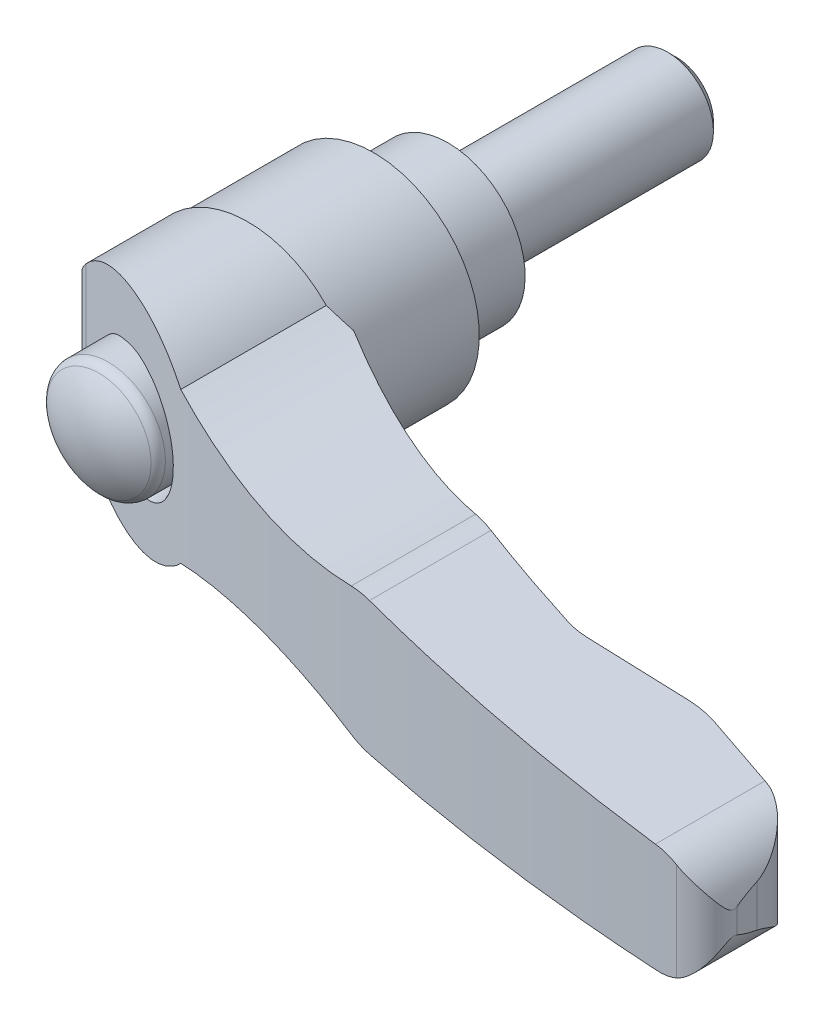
ISO-10303-21;
HEADER;
FILE_DESCRIPTION(('STEP AP214'),'2;1');
FILE_NAME('part.step','',(''),(''),'','','');
FILE_SCHEMA(('AUTOMOTIVE_DESIGN { 1 0 10303 214 1 1 1 1 }'));
ENDSEC;
DATA;
#1=APPLICATION_CONTEXT('core data for automotive mechanical design processes');
#2=APPLICATION_PROTOCOL_DEFINITION('international standard','automotive_design',2000,#1);
#3=PRODUCT_CONTEXT('',#1,'mechanical');
#4=PRODUCT('Part','Part','',(#3));
#5=PRODUCT_RELATED_PRODUCT_CATEGORY('part','',(#4));
#6=PRODUCT_DEFINITION_FORMATION('','',#4);
#7=PRODUCT_DEFINITION_CONTEXT('part definition',#1,'design');
#8=PRODUCT_DEFINITION('design','',#6,#7);
#9=PRODUCT_DEFINITION_SHAPE('','',#8);
#10=(LENGTH_UNIT() NAMED_UNIT(*) SI_UNIT(.MILLI.,.METRE.));
#11=(NAMED_UNIT(*) PLANE_ANGLE_UNIT() SI_UNIT($,.RADIAN.));
#12=(NAMED_UNIT(*) SI_UNIT($,.STERADIAN.) SOLID_ANGLE_UNIT());
#13=UNCERTAINTY_MEASURE_WITH_UNIT(LENGTH_MEASURE(1.E-05),#10,'distance_accuracy_value','');
#14=(GEOMETRIC_REPRESENTATION_CONTEXT(3) GLOBAL_UNCERTAINTY_ASSIGNED_CONTEXT((#13)) GLOBAL_UNIT_ASSIGNED_CONTEXT((#10,
#11,#12)) REPRESENTATION_CONTEXT('',''));
#15=CARTESIAN_POINT('',(0.,0.,0.));
#16=DIRECTION('',(0.,0.,1.));
#17=DIRECTION('',(1.,0.,0.));
#18=AXIS2_PLACEMENT_3D('',#15,#16,#17);
#19=CARTESIAN_POINT('',(0.,0.,-7.1165));
#20=DIRECTION('',(0.,0.,-1.));
#21=DIRECTION('',(0.,1.,0.));
#22=AXIS2_PLACEMENT_3D('',#19,#20,#21);
#23=CYLINDRICAL_SURFACE('',#22,4.);
#24=CARTESIAN_POINT('',(0.,0.,0.));
#25=DIRECTION('',(0.,0.,-1.));
#26=DIRECTION('',(0.,1.,0.));
#27=AXIS2_PLACEMENT_3D('',#24,#25,#26);
#28=CIRCLE('',#27,4.);
#29=CARTESIAN_POINT('',(0.,4.,0.));
#30=VERTEX_POINT('',#29);
#31=EDGE_CURVE('E17',#30,#30,#28,.F.);
#32=ORIENTED_EDGE('',*,*,#31,.F.);
#33=EDGE_LOOP('',(#32));
#34=FACE_BOUND('',#33,.T.);
#35=CARTESIAN_POINT('',(0.,0.,-19.2329999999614));
#36=DIRECTION('',(0.,0.,1.));
#37=DIRECTION('',(1.,0.,0.));
#38=AXIS2_PLACEMENT_3D('',#35,#36,#37);
#39=CIRCLE('',#38,4.);
#40=CARTESIAN_POINT('',(4.,0.,-19.2329999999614));
#41=VERTEX_POINT('',#40);
#42=EDGE_CURVE('E445',#41,#41,#39,.T.);
#43=ORIENTED_EDGE('',*,*,#42,.T.);
#44=EDGE_LOOP('',(#43));
#45=FACE_BOUND('',#44,.T.);
#46=ADVANCED_FACE('F14',(#34,#45),#23,.T.);
#47=CARTESIAN_POINT('',(5.375,0.,0.));
#48=DIRECTION('',(0.,0.,-1.));
#49=DIRECTION('',(0.,1.,0.));
#50=AXIS2_PLACEMENT_3D('',#47,#48,#49);
#51=PLANE('',#50);
#52=ORIENTED_EDGE('',*,*,#31,.T.);
#53=EDGE_LOOP('',(#52));
#54=FACE_BOUND('',#53,.T.);
#55=CARTESIAN_POINT('',(0.,0.,0.));
#56=DIRECTION('',(0.,0.,-1.));
#57=DIRECTION('',(0.,1.,0.));
#58=AXIS2_PLACEMENT_3D('',#55,#56,#57);
#59=CIRCLE('',#58,6.75);
#60=CARTESIAN_POINT('',(0.,6.75,0.));
#61=VERTEX_POINT('',#60);
#62=EDGE_CURVE('E194',#61,#61,#59,.F.);
#63=ORIENTED_EDGE('',*,*,#62,.F.);
#64=EDGE_LOOP('',(#63));
#65=FACE_BOUND('',#64,.T.);
#66=ADVANCED_FACE('F839',(#54,#65),#51,.T.);
#67=CARTESIAN_POINT('',(0.,0.,8.25));
#68=DIRECTION('',(0.,0.,-1.));
#69=DIRECTION('',(0.,1.,0.));
#70=AXIS2_PLACEMENT_3D('',#67,#68,#69);
#71=CYLINDRICAL_SURFACE('',#70,6.75);
#72=ORIENTED_EDGE('',*,*,#62,.T.);
#73=EDGE_LOOP('',(#72));
#74=FACE_BOUND('',#73,.T.);
#75=CARTESIAN_POINT('',(0.,0.,7.15000000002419));
#76=DIRECTION('',(0.,0.,-1.));
#77=DIRECTION('',(1.,0.,0.));
#78=AXIS2_PLACEMENT_3D('',#75,#76,#77);
#79=CIRCLE('',#78,6.74999999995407);
#80=CARTESIAN_POINT('',(6.74999999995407,0.,7.15000000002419));
#81=VERTEX_POINT('',#80);
#82=EDGE_CURVE('E192',#81,#81,#79,.T.);
#83=ORIENTED_EDGE('',*,*,#82,.T.);
#84=EDGE_LOOP('',(#83));
#85=FACE_BOUND('',#84,.T.);
#86=ADVANCED_FACE('F829',(#74,#85),#71,.T.);
#87=CARTESIAN_POINT('',(0.,0.,6.9000000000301));
#88=DIRECTION('',(0.,0.,-1.));
#89=DIRECTION('',(0.,1.,0.));
#90=AXIS2_PLACEMENT_3D('',#87,#88,#89);
#91=CONICAL_SURFACE('',#90,7.000000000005,0.785398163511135);
#92=ORIENTED_EDGE('',*,*,#82,.F.);
#93=EDGE_LOOP('',(#92));
#94=FACE_BOUND('',#93,.T.);
#95=CARTESIAN_POINT('',(0.,0.,6.9));
#96=DIRECTION('',(0.,0.,-1.));
#97=DIRECTION('',(0.,1.,0.));
#98=AXIS2_PLACEMENT_3D('',#95,#96,#97);
#99=CIRCLE('',#98,7.);
#100=CARTESIAN_POINT('',(0.,7.,6.9));
#101=VERTEX_POINT('',#100);
#102=EDGE_CURVE('E184',#101,#101,#99,.T.);
#103=ORIENTED_EDGE('',*,*,#102,.T.);
#104=EDGE_LOOP('',(#103));
#105=FACE_BOUND('',#104,.T.);
#106=ADVANCED_FACE('F819',(#94,#105),#91,.F.);
#107=CARTESIAN_POINT('',(0.,0.,6.2));
#108=DIRECTION('',(0.,0.,-1.));
#109=DIRECTION('',(0.,1.,0.));
#110=AXIS2_PLACEMENT_3D('',#107,#108,#109);
#111=CYLINDRICAL_SURFACE('',#110,7.);
#112=ORIENTED_EDGE('',*,*,#102,.F.);
#113=EDGE_LOOP('',(#112));
#114=FACE_BOUND('',#113,.T.);
#115=CARTESIAN_POINT('',(0.,0.,6.5));
#116=DIRECTION('',(0.,0.,-1.));
#117=DIRECTION('',(0.,1.,0.));
#118=AXIS2_PLACEMENT_3D('',#115,#116,#117);
#119=CIRCLE('',#118,7.);
#120=CARTESIAN_POINT('',(0.,7.,6.5));
#121=VERTEX_POINT('',#120);
#122=EDGE_CURVE('E181',#121,#121,#119,.F.);
#123=ORIENTED_EDGE('',*,*,#122,.F.);
#124=EDGE_LOOP('',(#123));
#125=FACE_BOUND('',#124,.T.);
#126=ADVANCED_FACE('F811',(#114,#125),#111,.F.);
#127=CARTESIAN_POINT('',(-9.01003775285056,-19.,6.5));
#128=DIRECTION('',(0.707106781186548,0.,0.707106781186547));
#129=DIRECTION('',(-0.707106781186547,0.,0.707106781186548));
#130=AXIS2_PLACEMENT_3D('',#127,#128,#129);
#131=PLANE('',#130);
#132=DIRECTION('',(0.,1.,0.));
#133=VECTOR('',#132,1.);
#134=CARTESIAN_POINT('',(-9.01003775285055,0.,6.5));
#135=LINE('',#134,#133);
#136=CARTESIAN_POINT('',(-9.01003775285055,-2.13584185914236,6.5));
#137=VERTEX_POINT('',#136);
#138=CARTESIAN_POINT('',(-9.01003775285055,2.13584185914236,6.5));
#139=VERTEX_POINT('',#138);
#140=EDGE_CURVE('E165',#137,#139,#135,.T.);
#141=ORIENTED_EDGE('',*,*,#140,.F.);
#142=CARTESIAN_POINT('',(-0.00999999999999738,0.,-2.50003775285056));
#143=DIRECTION('',(0.707106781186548,0.,0.707106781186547));
#144=DIRECTION('',(-0.707106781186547,0.,0.707106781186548));
#145=AXIS2_PLACEMENT_3D('',#142,#143,#144);
#146=ELLIPSE('',#145,13.0814754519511,9.25);
#147=EDGE_CURVE('E168',#139,#137,#146,.T.);
#148=ORIENTED_EDGE('',*,*,#147,.F.);
#149=EDGE_LOOP('',(#141,#148));
#150=FACE_BOUND('',#149,.T.);
#151=ADVANCED_FACE('F170',(#150),#131,.F.);
#152=CARTESIAN_POINT('',(-4.635,0.,6.5));
#153=DIRECTION('',(0.,0.,-1.));
#154=DIRECTION('',(0.,1.,0.));
#155=AXIS2_PLACEMENT_3D('',#152,#153,#154);
#156=PLANE('',#155);
#157=ORIENTED_EDGE('',*,*,#140,.T.);
#158=CARTESIAN_POINT('',(-0.00999999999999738,0.,6.5));
#159=DIRECTION('',(0.,0.,1.));
#160=DIRECTION('',(-1.,0.,0.));
#161=AXIS2_PLACEMENT_3D('',#158,#159,#160);
#162=CIRCLE('',#161,9.25);
#163=EDGE_CURVE('E172',#137,#139,#162,.T.);
#164=ORIENTED_EDGE('',*,*,#163,.F.);
#165=EDGE_LOOP('',(#157,#164));
#166=FACE_BOUND('',#165,.T.);
#167=ORIENTED_EDGE('',*,*,#122,.T.);
#168=EDGE_LOOP('',(#167));
#169=FACE_BOUND('',#168,.T.);
#170=ADVANCED_FACE('F179',(#166,#169),#156,.T.);
#171=CARTESIAN_POINT('',(-0.00999999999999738,0.,13.5625));
#172=DIRECTION('',(0.,0.,1.));
#173=DIRECTION('',(-1.,0.,0.));
#174=AXIS2_PLACEMENT_3D('',#171,#172,#173);
#175=CYLINDRICAL_SURFACE('',#174,9.25);
#176=ORIENTED_EDGE('',*,*,#163,.T.);
#177=ORIENTED_EDGE('',*,*,#147,.T.);
#178=EDGE_LOOP('',(#176,#177));
#179=FACE_BOUND('',#178,.T.);
#180=CARTESIAN_POINT('',(-0.00999999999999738,0.,17.5));
#181=DIRECTION('',(0.,0.,1.));
#182=DIRECTION('',(-1.,0.,0.));
#183=AXIS2_PLACEMENT_3D('',#180,#181,#182);
#184=CIRCLE('',#183,9.25);
#185=CARTESIAN_POINT('',(-9.26,0.,17.5));
#186=VERTEX_POINT('',#185);
#187=CARTESIAN_POINT('',(9.23999999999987,0.,17.5000000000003));
#188=VERTEX_POINT('',#187);
#189=EDGE_CURVE('E419',#186,#188,#184,.T.);
#190=ORIENTED_EDGE('',*,*,#189,.F.);
#191=CARTESIAN_POINT('',(-0.00999999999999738,0.,17.5));
#192=DIRECTION('',(0.,0.,1.));
#193=DIRECTION('',(-1.,0.,0.));
#194=AXIS2_PLACEMENT_3D('',#191,#192,#193);
#195=CIRCLE('',#194,9.25);
#196=EDGE_CURVE('E428',#188,#186,#195,.T.);
#197=ORIENTED_EDGE('',*,*,#196,.F.);
#198=EDGE_LOOP('',(#190,#197));
#199=FACE_BOUND('',#198,.T.);
#200=ADVANCED_FACE('F174',(#179,#199),#175,.T.);
#201=CARTESIAN_POINT('',(0.,0.,24.));
#202=DIRECTION('',(1.,0.,0.));
#203=DIRECTION('',(0.,0.,1.));
#204=AXIS2_PLACEMENT_3D('',#201,#202,#203);
#205=SPHERICAL_SURFACE('',#204,8.);
#206=CARTESIAN_POINT('',(0.,0.,30.5652144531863));
#207=DIRECTION('',(0.,0.,1.));
#208=DIRECTION('',(0.,-1.,0.));
#209=AXIS2_PLACEMENT_3D('',#206,#207,#208);
#210=CIRCLE('',#209,4.57142857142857);
#211=CARTESIAN_POINT('',(0.,-4.57142857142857,30.5652144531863));
#212=VERTEX_POINT('',#211);
#213=EDGE_CURVE('E403',#212,#212,#210,.F.);
#214=ORIENTED_EDGE('',*,*,#213,.F.);
#215=EDGE_LOOP('',(#214));
#216=FACE_BOUND('',#215,.T.);
#217=ADVANCED_FACE('F778',(#216),#205,.T.);
#218=CARTESIAN_POINT('',(64.6274051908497,-10.5,37.5817950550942));
#219=DIRECTION('',(0.992331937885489,0.,-0.123601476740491));
#220=DIRECTION('',(0.123601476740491,0.,0.992331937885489));
#221=AXIS2_PLACEMENT_3D('',#218,#219,#220);
#222=PLANE('',#221);
#223=CARTESIAN_POINT('',(60.25,0.,2.43788666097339));
#224=DIRECTION('',(0.992331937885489,0.,-0.123601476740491));
#225=DIRECTION('',(0.123601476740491,0.,0.992331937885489));
#226=AXIS2_PLACEMENT_3D('',#223,#224,#225);
#227=ELLIPSE('',#226,38.4299615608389,4.75);
#228=CARTESIAN_POINT('',(64.8745408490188,1.08449155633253,39.5659186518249));
#229=VERTEX_POINT('',#228);
#230=CARTESIAN_POINT('',(64.6274051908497,1.84413226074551,37.5817950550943));
#231=VERTEX_POINT('',#230);
#232=EDGE_CURVE('E555',#229,#231,#227,.F.);
#233=ORIENTED_EDGE('',*,*,#232,.F.);
#234=DIRECTION('',(0.,-1.,0.));
#235=VECTOR('',#234,1.);
#236=CARTESIAN_POINT('',(64.8745408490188,-10.5,39.5659186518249));
#237=LINE('',#236,#235);
#238=CARTESIAN_POINT('',(64.8745408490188,-1.08449155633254,39.5659186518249));
#239=VERTEX_POINT('',#238);
#240=EDGE_CURVE('E495',#239,#229,#237,.F.);
#241=ORIENTED_EDGE('',*,*,#240,.F.);
#242=CARTESIAN_POINT('',(60.25,0.,2.43788666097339));
#243=DIRECTION('',(0.992331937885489,0.,-0.123601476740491));
#244=DIRECTION('',(0.123601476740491,0.,0.992331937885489));
#245=AXIS2_PLACEMENT_3D('',#242,#243,#244);
#246=ELLIPSE('',#245,38.4299615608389,4.75);
#247=CARTESIAN_POINT('',(64.6274051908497,-1.84413226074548,37.5817950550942));
#248=VERTEX_POINT('',#247);
#249=EDGE_CURVE('E504',#248,#239,#246,.F.);
#250=ORIENTED_EDGE('',*,*,#249,.F.);
#251=DIRECTION('',(0.,-1.,0.));
#252=VECTOR('',#251,1.);
#253=CARTESIAN_POINT('',(64.6274051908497,-10.5,37.5817950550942));
#254=LINE('',#253,#252);
#255=EDGE_CURVE('E177',#231,#248,#254,.T.);
#256=ORIENTED_EDGE('',*,*,#255,.F.);
#257=EDGE_LOOP('',(#233,#241,#250,#256));
#258=FACE_BOUND('',#257,.T.);
#259=ADVANCED_FACE('F543',(#258),#222,.T.);
#260=CARTESIAN_POINT('',(58.6337202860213,-10.5,38.3283479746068));
#261=DIRECTION('',(0.,-1.,0.));
#262=DIRECTION('',(1.,0.,0.));
#263=AXIS2_PLACEMENT_3D('',#260,#261,#262);
#264=CYLINDRICAL_SURFACE('',#263,6.04);
#265=CARTESIAN_POINT('',(64.6274051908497,1.84413226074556,37.5817950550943));
#266=CARTESIAN_POINT('',(64.6175868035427,1.86745330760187,37.5030045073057));
#267=CARTESIAN_POINT('',(64.6063375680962,1.89362327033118,37.4253204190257));
#268=CARTESIAN_POINT('',(64.5811702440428,1.95049016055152,37.2721928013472));
#269=CARTESIAN_POINT('',(64.5672561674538,1.98118026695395,37.196746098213));
#270=CARTESIAN_POINT('',(64.5369883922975,2.04585034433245,37.0482136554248));
#271=CARTESIAN_POINT('',(64.520645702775,2.07981523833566,36.9751189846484));
#272=CARTESIAN_POINT('',(64.4855821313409,2.15032519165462,36.8307396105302));
#273=CARTESIAN_POINT('',(64.4668602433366,2.18687133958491,36.7594556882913));
#274=CARTESIAN_POINT('',(64.4072221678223,2.29938724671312,36.547961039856));
#275=CARTESIAN_POINT('',(64.3628565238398,2.37818379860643,36.410218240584));
#276=CARTESIAN_POINT('',(64.2652007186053,2.53960895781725,36.1400450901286));
#277=CARTESIAN_POINT('',(64.2118976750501,2.6222429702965,36.007622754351));
#278=CARTESIAN_POINT('',(64.077119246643,2.81672317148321,35.7040219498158));
#279=CARTESIAN_POINT('',(63.9921849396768,2.92909268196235,35.5347005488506));
#280=CARTESIAN_POINT('',(63.8063278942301,3.15216626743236,35.2039790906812));
#281=CARTESIAN_POINT('',(63.7054078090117,3.26287061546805,35.0425777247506));
#282=CARTESIAN_POINT('',(63.4870671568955,3.47959027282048,34.7278934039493));
#283=CARTESIAN_POINT('',(63.369645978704,3.58560540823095,34.5746107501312));
#284=CARTESIAN_POINT('',(63.1179209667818,3.7899652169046,34.277236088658));
#285=CARTESIAN_POINT('',(62.9836257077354,3.88831374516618,34.1331394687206));
#286=CARTESIAN_POINT('',(62.6561598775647,4.10136712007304,33.815313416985));
#287=CARTESIAN_POINT('',(62.4571888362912,4.2125890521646,33.6450495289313));
#288=CARTESIAN_POINT('',(62.1378586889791,4.36029911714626,33.4069452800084));
#289=CARTESIAN_POINT('',(62.0281124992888,4.40629516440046,33.330558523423));
#290=CARTESIAN_POINT('',(61.8018114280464,4.49098569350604,33.1841350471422));
#291=CARTESIAN_POINT('',(61.6852609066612,4.52968478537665,33.1140943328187));
#292=CARTESIAN_POINT('',(61.4786111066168,4.58924867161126,32.9993621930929));
#293=CARTESIAN_POINT('',(61.3900115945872,4.61209493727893,32.9529824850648));
#294=CARTESIAN_POINT('',(61.209734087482,4.65295056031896,32.8642982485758));
#295=CARTESIAN_POINT('',(61.1180570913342,4.67096147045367,32.82199241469));
#296=CARTESIAN_POINT('',(60.9313596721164,4.70183469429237,32.7415027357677));
#297=CARTESIAN_POINT('',(60.8363219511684,4.71466416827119,32.7033462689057));
#298=CARTESIAN_POINT('',(60.6438287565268,4.73463763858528,32.631712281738));
#299=CARTESIAN_POINT('',(60.5463713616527,4.74177695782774,32.5982386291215));
#300=CARTESIAN_POINT('',(60.4479724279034,4.74587261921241,32.5672639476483));
#301=B_SPLINE_CURVE_WITH_KNOTS('',3,(#265,#266,#267,#268,#269,#270,#271,#272,#273,#274,#275,
#276,#277,#278,#279,#280,#281,#282,#283,#284,#285,#286,#287,#288,#289,#290,#291,#292,#293,#294,
#295,#296,#297,#298,#299,#300),.UNSPECIFIED.,.F.,.F.,(4,2,2,2,2,2,2,2,2,2,2,2,2,2,2,2,2,4),(0.,
0.248076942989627,0.495783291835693,0.742399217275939,0.989119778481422,1.48293160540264,
1.97746142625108,2.63745339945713,3.29733594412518,3.95724294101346,4.61681594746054,
5.46693586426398,5.89075482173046,6.31430511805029,6.62183365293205,6.92926331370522,
7.23861197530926,7.54821464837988),.UNSPECIFIED.);
#302=CARTESIAN_POINT('',(60.4479724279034,4.74587261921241,32.5672639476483));
#303=VERTEX_POINT('',#302);
#304=EDGE_CURVE('E494',#231,#303,#301,.T.);
#305=ORIENTED_EDGE('',*,*,#304,.F.);
#306=ORIENTED_EDGE('',*,*,#255,.T.);
#307=CARTESIAN_POINT('',(60.4479724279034,-4.74587261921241,32.5672639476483));
#308=CARTESIAN_POINT('',(60.5755504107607,-4.74057354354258,32.6074069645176));
#309=CARTESIAN_POINT('',(60.7015088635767,-4.73014540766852,32.6517620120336));
#310=CARTESIAN_POINT('',(60.9490652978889,-4.69992242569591,32.7481786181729));
#311=CARTESIAN_POINT('',(61.0706698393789,-4.6801423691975,32.8002279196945));
#312=CARTESIAN_POINT('',(61.3074659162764,-4.63235500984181,32.9108206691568));
#313=CARTESIAN_POINT('',(61.4227141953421,-4.60444273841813,32.9692844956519));
#314=CARTESIAN_POINT('',(61.6477173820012,-4.54120548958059,33.0925213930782));
#315=CARTESIAN_POINT('',(61.7574696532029,-4.50587699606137,33.1572974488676));
#316=CARTESIAN_POINT('',(61.9940137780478,-4.42040174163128,33.307032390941));
#317=CARTESIAN_POINT('',(62.1193938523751,-4.36870213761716,33.3933358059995));
#318=CARTESIAN_POINT('',(62.3610721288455,-4.25718277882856,33.5732278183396));
#319=CARTESIAN_POINT('',(62.4773638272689,-4.19735729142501,33.6668215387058));
#320=CARTESIAN_POINT('',(62.7012840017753,-4.07066877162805,33.8608437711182));
#321=CARTESIAN_POINT('',(62.8088611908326,-4.00376876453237,33.9613071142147));
#322=CARTESIAN_POINT('',(63.0146476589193,-3.86453813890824,34.1677809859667));
#323=CARTESIAN_POINT('',(63.1128596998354,-3.79220913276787,34.2737898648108));
#324=CARTESIAN_POINT('',(63.3331746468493,-3.6170051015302,34.5290929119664));
#325=CARTESIAN_POINT('',(63.4514763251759,-3.51235864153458,34.6804594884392));
#326=CARTESIAN_POINT('',(63.6718053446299,-3.29808480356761,34.9913387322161));
#327=CARTESIAN_POINT('',(63.7738256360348,-3.18845529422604,35.1508548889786));
#328=CARTESIAN_POINT('',(63.961662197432,-2.96765680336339,35.4770445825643));
#329=CARTESIAN_POINT('',(64.0475378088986,-2.85649513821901,35.6436890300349));
#330=CARTESIAN_POINT('',(64.2038484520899,-2.63586419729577,35.9851508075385));
#331=CARTESIAN_POINT('',(64.2742871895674,-2.52639452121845,36.1599661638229));
#332=CARTESIAN_POINT('',(64.3705847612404,-2.36382517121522,36.4361542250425));
#333=CARTESIAN_POINT('',(64.4019853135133,-2.30809068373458,36.5340606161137));
#334=CARTESIAN_POINT('',(64.4601539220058,-2.20019362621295,36.7330390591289));
#335=CARTESIAN_POINT('',(64.4869269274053,-2.14802727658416,36.8341075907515));
#336=CARTESIAN_POINT('',(64.5357331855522,-2.0489078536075,37.0402846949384));
#337=CARTESIAN_POINT('',(64.5577546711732,-2.00196785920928,37.1454025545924));
#338=CARTESIAN_POINT('',(64.5966140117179,-1.91618262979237,37.360168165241));
#339=CARTESIAN_POINT('',(64.6134353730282,-1.87736327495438,37.4698291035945));
#340=CARTESIAN_POINT('',(64.6274051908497,-1.84413226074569,37.5817950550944));
#341=B_SPLINE_CURVE_WITH_KNOTS('',3,(#307,#308,#309,#310,#311,#312,#313,#314,#315,#316,#317,
#318,#319,#320,#321,#322,#323,#324,#325,#326,#327,#328,#329,#330,#331,#332,#333,#334,#335,#336,
#337,#338,#339,#340),.UNSPECIFIED.,.F.,.F.,(4,2,2,2,2,2,2,2,2,2,2,2,2,2,2,2,4),(0.,
0.401264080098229,0.801895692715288,1.19802151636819,1.5943355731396,2.07588331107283,
2.55777255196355,3.04231807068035,3.52672024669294,4.18208013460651,4.83772302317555,
5.49090678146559,6.14393356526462,6.4946438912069,6.84497677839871,7.19616755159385,
7.54846105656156),.UNSPECIFIED.);
#342=CARTESIAN_POINT('',(60.4479724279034,-4.74587261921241,32.5672639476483));
#343=VERTEX_POINT('',#342);
#344=EDGE_CURVE('E507',#343,#248,#341,.T.);
#345=ORIENTED_EDGE('',*,*,#344,.F.);
#346=DIRECTION('',(0.,-1.,0.));
#347=VECTOR('',#346,1.);
#348=CARTESIAN_POINT('',(60.4479724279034,-10.5,32.5672639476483));
#349=LINE('',#348,#347);
#350=EDGE_CURVE('E417',#303,#343,#349,.T.);
#351=ORIENTED_EDGE('',*,*,#350,.F.);
#352=EDGE_LOOP('',(#305,#306,#345,#351));
#353=FACE_BOUND('',#352,.T.);
#354=ADVANCED_FACE('F537',(#353),#264,.T.);
#355=CARTESIAN_POINT('',(-9.26,-10.5,17.5));
#356=DIRECTION('',(0.,0.,-1.));
#357=DIRECTION('',(0.,1.,0.));
#358=AXIS2_PLACEMENT_3D('',#355,#356,#357);
#359=PLANE('',#358);
#360=DIRECTION('',(0.,-1.,0.));
#361=VECTOR('',#360,1.);
#362=CARTESIAN_POINT('',(-9.26,-10.5,17.5));
#363=LINE('',#362,#361);
#364=CARTESIAN_POINT('',(-9.26,2.12188595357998,17.5));
#365=VERTEX_POINT('',#364);
#366=EDGE_CURVE('E426',#365,#186,#363,.T.);
#367=ORIENTED_EDGE('',*,*,#366,.F.);
#368=CARTESIAN_POINT('',(0.,0.,17.5));
#369=DIRECTION('',(0.,0.,1.));
#370=DIRECTION('',(0.,-1.,0.));
#371=AXIS2_PLACEMENT_3D('',#368,#369,#370);
#372=CIRCLE('',#371,9.5);
#373=CARTESIAN_POINT('',(6.8437408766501,6.58887022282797,17.5));
#374=VERTEX_POINT('',#373);
#375=EDGE_CURVE('E340',#374,#365,#372,.T.);
#376=ORIENTED_EDGE('',*,*,#375,.F.);
#377=CARTESIAN_POINT('',(19.25,44.09,17.5));
#378=DIRECTION('',(0.,0.,1.));
#379=DIRECTION('',(0.,-1.,0.));
#380=AXIS2_PLACEMENT_3D('',#377,#378,#379);
#381=CIRCLE('',#380,39.5);
#382=CARTESIAN_POINT('',(9.23999999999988,5.8794006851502,17.5000000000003));
#383=VERTEX_POINT('',#382);
#384=EDGE_CURVE('E300',#374,#383,#381,.T.);
#385=ORIENTED_EDGE('',*,*,#384,.T.);
#386=DIRECTION('',(0.,-1.,0.));
#387=VECTOR('',#386,1.);
#388=CARTESIAN_POINT('',(9.23999999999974,-10.5,17.5000000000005));
#389=LINE('',#388,#387);
#390=EDGE_CURVE('E406',#383,#188,#389,.T.);
#391=ORIENTED_EDGE('',*,*,#390,.T.);
#392=ORIENTED_EDGE('',*,*,#196,.T.);
#393=EDGE_LOOP('',(#367,#376,#385,#391,#392));
#394=FACE_BOUND('',#393,.T.);
#395=ADVANCED_FACE('F542',(#394),#359,.T.);
#396=CARTESIAN_POINT('',(-9.26,-10.5,21.2038249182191));
#397=DIRECTION('',(-1.,0.,0.));
#398=DIRECTION('',(0.,-1.,0.));
#399=AXIS2_PLACEMENT_3D('',#396,#397,#398);
#400=PLANE('',#399);
#401=ORIENTED_EDGE('',*,*,#366,.T.);
#402=DIRECTION('',(0.,1.,0.));
#403=VECTOR('',#402,1.);
#404=CARTESIAN_POINT('',(-9.26,-10.5,17.5));
#405=LINE('',#404,#403);
#406=CARTESIAN_POINT('',(-9.26,-2.12188595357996,17.5));
#407=VERTEX_POINT('',#406);
#408=EDGE_CURVE('E420',#407,#186,#405,.T.);
#409=ORIENTED_EDGE('',*,*,#408,.F.);
#410=DIRECTION('',(0.,0.,1.));
#411=VECTOR('',#410,1.);
#412=CARTESIAN_POINT('',(-9.26,-2.12188595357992,42.5));
#413=LINE('',#412,#411);
#414=CARTESIAN_POINT('',(-9.26,-2.12188595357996,21.2038249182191));
#415=VERTEX_POINT('',#414);
#416=EDGE_CURVE('E423',#415,#407,#413,.F.);
#417=ORIENTED_EDGE('',*,*,#416,.F.);
#418=DIRECTION('',(0.,-1.,0.));
#419=VECTOR('',#418,1.);
#420=CARTESIAN_POINT('',(-9.26,-10.5,21.2038249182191));
#421=LINE('',#420,#419);
#422=CARTESIAN_POINT('',(-9.26,2.12188595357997,21.2038249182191));
#423=VERTEX_POINT('',#422);
#424=EDGE_CURVE('E475',#423,#415,#421,.T.);
#425=ORIENTED_EDGE('',*,*,#424,.F.);
#426=DIRECTION('',(0.,0.,1.));
#427=VECTOR('',#426,1.);
#428=CARTESIAN_POINT('',(-9.26,2.12188595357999,42.5));
#429=LINE('',#428,#427);
#430=EDGE_CURVE('E343',#365,#423,#429,.T.);
#431=ORIENTED_EDGE('',*,*,#430,.F.);
#432=EDGE_LOOP('',(#401,#409,#417,#425,#431));
#433=FACE_BOUND('',#432,.T.);
#434=ADVANCED_FACE('F740',(#433),#400,.T.);
#435=CARTESIAN_POINT('',(-9.26,-10.5,17.5));
#436=DIRECTION('',(0.,0.,-1.));
#437=DIRECTION('',(0.,1.,0.));
#438=AXIS2_PLACEMENT_3D('',#435,#436,#437);
#439=PLANE('',#438);
#440=DIRECTION('',(0.,-1.,0.));
#441=VECTOR('',#440,1.);
#442=CARTESIAN_POINT('',(9.23999999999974,-10.5,17.5000000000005));
#443=LINE('',#442,#441);
#444=CARTESIAN_POINT('',(9.23999999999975,-5.87940068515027,17.5000000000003));
#445=VERTEX_POINT('',#444);
#446=EDGE_CURVE('E404',#188,#445,#443,.T.);
#447=ORIENTED_EDGE('',*,*,#446,.T.);
#448=CARTESIAN_POINT('',(19.25,-44.09,17.5));
#449=DIRECTION('',(0.,0.,1.));
#450=DIRECTION('',(0.,-1.,0.));
#451=AXIS2_PLACEMENT_3D('',#448,#449,#450);
#452=CIRCLE('',#451,39.5);
#453=CARTESIAN_POINT('',(6.84374087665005,-6.588870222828,17.5));
#454=VERTEX_POINT('',#453);
#455=EDGE_CURVE('E474',#445,#454,#452,.T.);
#456=ORIENTED_EDGE('',*,*,#455,.T.);
#457=CARTESIAN_POINT('',(0.,0.,17.5));
#458=DIRECTION('',(0.,0.,1.));
#459=DIRECTION('',(0.,-1.,0.));
#460=AXIS2_PLACEMENT_3D('',#457,#458,#459);
#461=CIRCLE('',#460,9.5);
#462=EDGE_CURVE('E478',#407,#454,#461,.T.);
#463=ORIENTED_EDGE('',*,*,#462,.F.);
#464=ORIENTED_EDGE('',*,*,#408,.T.);
#465=ORIENTED_EDGE('',*,*,#189,.T.);
#466=EDGE_LOOP('',(#447,#456,#463,#464,#465));
#467=FACE_BOUND('',#466,.T.);
#468=ADVANCED_FACE('F732',(#467),#439,.T.);
#469=CARTESIAN_POINT('',(53.8294507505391,-10.5,30.4829917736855));
#470=DIRECTION('',(0.300372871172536,0.,-0.953821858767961));
#471=DIRECTION('',(0.953821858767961,0.,0.300372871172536));
#472=AXIS2_PLACEMENT_3D('',#469,#470,#471);
#473=PLANE('',#472);
#474=CARTESIAN_POINT('',(60.25,0.,32.5049194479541));
#475=DIRECTION('',(0.300372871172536,0.,-0.953821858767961));
#476=DIRECTION('',(0.953821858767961,0.,0.300372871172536));
#477=AXIS2_PLACEMENT_3D('',#474,#475,#476);
#478=ELLIPSE('',#477,4.97996555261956,4.75);
#479=CARTESIAN_POINT('',(60.25,4.75,32.5049194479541));
#480=VERTEX_POINT('',#479);
#481=EDGE_CURVE('E496',#303,#480,#478,.F.);
#482=ORIENTED_EDGE('',*,*,#481,.F.);
#483=ORIENTED_EDGE('',*,*,#350,.T.);
#484=CARTESIAN_POINT('',(60.25,0.,32.5049194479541));
#485=DIRECTION('',(0.300372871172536,0.,-0.953821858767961));
#486=DIRECTION('',(0.953821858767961,0.,0.300372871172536));
#487=AXIS2_PLACEMENT_3D('',#484,#485,#486);
#488=ELLIPSE('',#487,4.97996555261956,4.75);
#489=CARTESIAN_POINT('',(60.25,-4.75,32.5049194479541));
#490=VERTEX_POINT('',#489);
#491=EDGE_CURVE('E536',#490,#343,#488,.F.);
#492=ORIENTED_EDGE('',*,*,#491,.F.);
#493=DIRECTION('',(-0.953255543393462,-0.0344545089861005,-0.300194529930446));
#494=VECTOR('',#493,1.);
#495=CARTESIAN_POINT('',(60.25,-4.75,32.5049194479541));
#496=LINE('',#495,#494);
#497=CARTESIAN_POINT('',(53.8294507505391,-4.98206460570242,30.4829917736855));
#498=VERTEX_POINT('',#497);
#499=EDGE_CURVE('E464',#490,#498,#496,.T.);
#500=ORIENTED_EDGE('',*,*,#499,.T.);
#501=DIRECTION('',(0.,-1.,0.));
#502=VECTOR('',#501,1.);
#503=CARTESIAN_POINT('',(53.8294507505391,-10.5,30.4829917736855));
#504=LINE('',#503,#502);
#505=CARTESIAN_POINT('',(53.8294507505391,4.98206460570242,30.4829917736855));
#506=VERTEX_POINT('',#505);
#507=EDGE_CURVE('E414',#506,#498,#504,.T.);
#508=ORIENTED_EDGE('',*,*,#507,.F.);
#509=DIRECTION('',(0.953255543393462,-0.0344545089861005,0.300194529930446));
#510=VECTOR('',#509,1.);
#511=CARTESIAN_POINT('',(53.8294507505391,4.98206460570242,30.4829917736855));
#512=LINE('',#511,#510);
#513=EDGE_CURVE('E299',#506,#480,#512,.T.);
#514=ORIENTED_EDGE('',*,*,#513,.T.);
#515=EDGE_LOOP('',(#482,#483,#492,#500,#508,#514));
#516=FACE_BOUND('',#515,.T.);
#517=ADVANCED_FACE('F573',(#516),#473,.T.);
#518=CARTESIAN_POINT('',(51.0780352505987,-10.5,39.22));
#519=DIRECTION('',(0.,-1.,0.));
#520=DIRECTION('',(1.,0.,0.));
#521=AXIS2_PLACEMENT_3D('',#518,#519,#520);
#522=CYLINDRICAL_SURFACE('',#521,9.15999999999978);
#523=CARTESIAN_POINT('',(51.0780352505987,5.08151188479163,39.22));
#524=DIRECTION('',(-0.0361204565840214,-0.999347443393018,0.));
#525=DIRECTION('',(0.999347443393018,-0.0361204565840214,0.));
#526=AXIS2_PLACEMENT_3D('',#523,#524,#525);
#527=ELLIPSE('',#526,9.16598132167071,9.15999999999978);
#528=CARTESIAN_POINT('',(51.0780352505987,5.08151188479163,30.06));
#529=VERTEX_POINT('',#528);
#530=EDGE_CURVE('E302',#529,#506,#527,.T.);
#531=ORIENTED_EDGE('',*,*,#530,.T.);
#532=ORIENTED_EDGE('',*,*,#507,.T.);
#533=CARTESIAN_POINT('',(51.0780352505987,-5.08151188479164,39.22));
#534=DIRECTION('',(-0.0361204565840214,0.999347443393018,0.));
#535=DIRECTION('',(-0.999347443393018,-0.0361204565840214,0.));
#536=AXIS2_PLACEMENT_3D('',#533,#534,#535);
#537=ELLIPSE('',#536,9.16598132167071,9.15999999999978);
#538=CARTESIAN_POINT('',(51.0780352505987,-5.08151188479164,30.06));
#539=VERTEX_POINT('',#538);
#540=EDGE_CURVE('E463',#498,#539,#537,.T.);
#541=ORIENTED_EDGE('',*,*,#540,.T.);
#542=DIRECTION('',(0.,1.,0.));
#543=VECTOR('',#542,1.);
#544=CARTESIAN_POINT('',(51.0780352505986,-10.5,30.06));
#545=LINE('',#544,#543);
#546=EDGE_CURVE('E411',#529,#539,#545,.F.);
#547=ORIENTED_EDGE('',*,*,#546,.F.);
#548=EDGE_LOOP('',(#531,#532,#541,#547));
#549=FACE_BOUND('',#548,.T.);
#550=ADVANCED_FACE('F716',(#549),#522,.T.);
#551=CARTESIAN_POINT('',(42.239481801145,-10.5,30.06));
#552=DIRECTION('',(0.,0.,-1.));
#553=DIRECTION('',(0.,1.,0.));
#554=AXIS2_PLACEMENT_3D('',#551,#552,#553);
#555=PLANE('',#554);
#556=DIRECTION('',(0.999347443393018,-0.0361204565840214,0.));
#557=VECTOR('',#556,1.);
#558=CARTESIAN_POINT('',(30.3472861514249,5.83080496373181,30.06));
#559=LINE('',#558,#557);
#560=CARTESIAN_POINT('',(42.239481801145,5.4009729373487,30.06));
#561=VERTEX_POINT('',#560);
#562=EDGE_CURVE('E488',#561,#529,#559,.T.);
#563=ORIENTED_EDGE('',*,*,#562,.T.);
#564=ORIENTED_EDGE('',*,*,#546,.T.);
#565=DIRECTION('',(-0.999347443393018,-0.0361204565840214,0.));
#566=VECTOR('',#565,1.);
#567=CARTESIAN_POINT('',(60.25,-4.75,30.06));
#568=LINE('',#567,#566);
#569=CARTESIAN_POINT('',(42.239481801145,-5.4009729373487,30.06));
#570=VERTEX_POINT('',#569);
#571=EDGE_CURVE('E460',#539,#570,#568,.T.);
#572=ORIENTED_EDGE('',*,*,#571,.T.);
#573=DIRECTION('',(0.,-1.,0.));
#574=VECTOR('',#573,1.);
#575=CARTESIAN_POINT('',(42.239481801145,-10.5,30.06));
#576=LINE('',#575,#574);
#577=EDGE_CURVE('E409',#570,#561,#576,.F.);
#578=ORIENTED_EDGE('',*,*,#577,.T.);
#579=EDGE_LOOP('',(#563,#564,#572,#578));
#580=FACE_BOUND('',#579,.T.);
#581=ADVANCED_FACE('F708',(#580),#555,.T.);
#582=CARTESIAN_POINT('',(42.2394818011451,-10.5,23.0799999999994));
#583=DIRECTION('',(0.,-1.,0.));
#584=DIRECTION('',(1.,0.,0.));
#585=AXIS2_PLACEMENT_3D('',#582,#583,#584);
#586=CYLINDRICAL_SURFACE('',#585,6.98000000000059);
#587=DIRECTION('',(0.,-1.,0.));
#588=VECTOR('',#587,1.);
#589=CARTESIAN_POINT('',(40.3024609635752,-10.5,29.785844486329));
#590=LINE('',#589,#588);
#591=CARTESIAN_POINT('',(40.3024609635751,-5.47098470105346,29.7858444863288));
#592=VERTEX_POINT('',#591);
#593=CARTESIAN_POINT('',(40.3024609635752,5.47098470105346,29.7858444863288));
#594=VERTEX_POINT('',#593);
#595=EDGE_CURVE('E401',#592,#594,#590,.F.);
#596=ORIENTED_EDGE('',*,*,#595,.T.);
#597=CARTESIAN_POINT('',(42.2394818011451,5.40097293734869,23.0799999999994));
#598=DIRECTION('',(-0.0361204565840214,-0.999347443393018,0.));
#599=DIRECTION('',(0.999347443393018,-0.0361204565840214,0.));
#600=AXIS2_PLACEMENT_3D('',#597,#598,#599);
#601=ELLIPSE('',#600,6.98455781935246,6.98000000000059);
#602=EDGE_CURVE('E491',#594,#561,#601,.F.);
#603=ORIENTED_EDGE('',*,*,#602,.T.);
#604=ORIENTED_EDGE('',*,*,#577,.F.);
#605=CARTESIAN_POINT('',(42.2394818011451,-5.4009729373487,23.0799999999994));
#606=DIRECTION('',(-0.0361204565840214,0.999347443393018,0.));
#607=DIRECTION('',(-0.999347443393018,-0.0361204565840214,0.));
#608=AXIS2_PLACEMENT_3D('',#605,#606,#607);
#609=ELLIPSE('',#608,6.98455781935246,6.98000000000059);
#610=EDGE_CURVE('E462',#570,#592,#609,.F.);
#611=ORIENTED_EDGE('',*,*,#610,.T.);
#612=EDGE_LOOP('',(#596,#603,#604,#611));
#613=FACE_BOUND('',#612,.T.);
#614=ADVANCED_FACE('F310',(#613),#586,.F.);
#615=CARTESIAN_POINT('',(88.9416647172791,-10.5,-138.600024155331));
#616=DIRECTION('',(0.,-1.,0.));
#617=DIRECTION('',(1.,0.,0.));
#618=AXIS2_PLACEMENT_3D('',#615,#616,#617);
#619=CYLINDRICAL_SURFACE('',#618,175.27);
#620=CARTESIAN_POINT('',(30.3472861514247,5.83080496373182,26.5855433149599));
#621=CARTESIAN_POINT('',(30.1696679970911,5.83722947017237,26.5225405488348));
#622=CARTESIAN_POINT('',(29.9919650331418,5.83772087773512,26.45918181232));
#623=CARTESIAN_POINT('',(29.6377732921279,5.82691956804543,26.3322542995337));
#624=CARTESIAN_POINT('',(29.461282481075,5.81567269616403,26.2686872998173));
#625=CARTESIAN_POINT('',(29.1095062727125,5.78152581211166,26.1413510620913));
#626=CARTESIAN_POINT('',(28.9342208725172,5.75862582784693,26.0775818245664));
#627=CARTESIAN_POINT('',(28.5848474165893,5.70116062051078,25.9498538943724));
#628=CARTESIAN_POINT('',(28.4107667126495,5.6665501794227,25.8858954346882));
#629=CARTESIAN_POINT('',(28.2379732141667,5.62616845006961,25.8220994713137));
#630=B_SPLINE_CURVE_WITH_KNOTS('',3,(#620,#621,#622,#623,#624,#625,#626,#627,#628,#629),
.UNSPECIFIED.,.F.,.F.,(4,2,2,2,4),(0.,0.565613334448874,1.1290258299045,1.69243697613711,
2.2580489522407),.UNSPECIFIED.);
#631=CARTESIAN_POINT('',(30.3472861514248,5.83080496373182,26.5855433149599));
#632=VERTEX_POINT('',#631);
#633=CARTESIAN_POINT('',(28.2379732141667,5.62616845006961,25.8220994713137));
#634=VERTEX_POINT('',#633);
#635=EDGE_CURVE('E290',#632,#634,#630,.T.);
#636=ORIENTED_EDGE('',*,*,#635,.F.);
#637=CARTESIAN_POINT('',(88.9416647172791,3.71296724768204,-138.600024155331));
#638=DIRECTION('',(-0.0361204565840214,-0.999347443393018,0.));
#639=DIRECTION('',(0.999347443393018,-0.0361204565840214,0.));
#640=AXIS2_PLACEMENT_3D('',#637,#638,#639);
#641=ELLIPSE('',#640,175.384448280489,175.27);
#642=EDGE_CURVE('E493',#632,#594,#641,.F.);
#643=ORIENTED_EDGE('',*,*,#642,.T.);
#644=ORIENTED_EDGE('',*,*,#595,.F.);
#645=CARTESIAN_POINT('',(88.9416647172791,-3.71296724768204,-138.600024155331));
#646=DIRECTION('',(-0.0361204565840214,0.999347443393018,0.));
#647=DIRECTION('',(-0.999347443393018,-0.0361204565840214,0.));
#648=AXIS2_PLACEMENT_3D('',#645,#646,#647);
#649=ELLIPSE('',#648,175.384448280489,175.27);
#650=CARTESIAN_POINT('',(30.3472861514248,-5.83080496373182,26.5855433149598));
#651=VERTEX_POINT('',#650);
#652=EDGE_CURVE('E396',#592,#651,#649,.F.);
#653=ORIENTED_EDGE('',*,*,#652,.T.);
#654=CARTESIAN_POINT('',(28.237973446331,-5.6261685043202,25.8220995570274));
#655=CARTESIAN_POINT('',(28.4107669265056,-5.66655022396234,25.8858955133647));
#656=CARTESIAN_POINT('',(28.584847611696,-5.70116065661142,25.9498539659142));
#657=CARTESIAN_POINT('',(28.9342210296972,-5.75862584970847,26.0775818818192));
#658=CARTESIAN_POINT('',(29.1095064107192,-5.78152582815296,26.1413511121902));
#659=CARTESIAN_POINT('',(29.461282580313,-5.81567270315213,26.2686873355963));
#660=CARTESIAN_POINT('',(29.6377733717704,-5.82691957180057,26.3322543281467));
#661=CARTESIAN_POINT('',(29.9919650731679,-5.83772087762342,26.4591818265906));
#662=CARTESIAN_POINT('',(30.169668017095,-5.83722946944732,26.5225405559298));
#663=CARTESIAN_POINT('',(30.3472861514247,-5.83080496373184,26.5855433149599));
#664=B_SPLINE_CURVE_WITH_KNOTS('',3,(#654,#655,#656,#657,#658,#659,#660,#661,#662,#663),
.UNSPECIFIED.,.F.,.F.,(4,2,2,2,4),(0.,0.565611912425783,1.12902299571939,1.69243542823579,
2.25804869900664),.UNSPECIFIED.);
#665=CARTESIAN_POINT('',(28.237973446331,-5.6261685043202,25.8220995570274));
#666=VERTEX_POINT('',#665);
#667=EDGE_CURVE('E327',#666,#651,#664,.T.);
#668=ORIENTED_EDGE('',*,*,#667,.F.);
#669=CARTESIAN_POINT('',(28.237973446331,-5.6261685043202,25.8220995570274));
#670=CARTESIAN_POINT('',(27.6467124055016,-5.48799745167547,25.6038196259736));
#671=CARTESIAN_POINT('',(27.0537779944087,-5.3638308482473,25.3812778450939));
#672=CARTESIAN_POINT('',(25.8659006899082,-5.14331117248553,24.9280288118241));
#673=CARTESIAN_POINT('',(25.2709579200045,-5.04695642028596,24.6973220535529));
#674=CARTESIAN_POINT('',(24.0803912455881,-4.88185687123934,24.2280988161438));
#675=CARTESIAN_POINT('',(23.4847674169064,-4.81310925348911,23.9895831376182));
#676=CARTESIAN_POINT('',(22.2940534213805,-4.70292970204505,23.5051335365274));
#677=CARTESIAN_POINT('',(21.6989632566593,-4.66149787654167,23.2591995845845));
#678=CARTESIAN_POINT('',(19.93823636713,-4.57874286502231,22.520112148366));
#679=CARTESIAN_POINT('',(18.7748149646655,-4.57591682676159,22.0168726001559));
#680=CARTESIAN_POINT('',(16.4631439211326,-4.67145944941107,20.9870607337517));
#681=CARTESIAN_POINT('',(15.3148886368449,-4.76978933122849,20.4604974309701));
#682=CARTESIAN_POINT('',(13.7610005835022,-4.97097993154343,19.7276539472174));
#683=CARTESIAN_POINT('',(13.3455946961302,-5.03153416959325,19.5297267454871));
#684=CARTESIAN_POINT('',(12.518128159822,-5.16561835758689,19.1314774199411));
#685=CARTESIAN_POINT('',(12.1060667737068,-5.23914536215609,18.9311558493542));
#686=CARTESIAN_POINT('',(11.282699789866,-5.39957122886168,18.526898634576));
#687=CARTESIAN_POINT('',(10.8714191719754,-5.48655913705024,18.3229475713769));
#688=CARTESIAN_POINT('',(10.0527171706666,-5.67338492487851,17.9129677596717));
#689=CARTESIAN_POINT('',(9.64529662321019,-5.77322552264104,17.7069385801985));
#690=CARTESIAN_POINT('',(9.23999999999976,-5.87940068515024,17.5000000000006));
#691=B_SPLINE_CURVE_WITH_KNOTS('',3,(#669,#670,#671,#672,#673,#674,#675,#676,#677,#678,#679,
#680,#681,#682,#683,#684,#685,#686,#687,#688,#689,#690),.UNSPECIFIED.,.F.,.F.,(4,2,2,2,2,2,2,2,
2,2,4),(0.,1.93549726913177,3.87087760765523,5.80606013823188,7.74125033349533,11.5393004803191,
15.3358951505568,16.7281050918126,18.1199993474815,19.5215293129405,20.9233561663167),.UNSPECIFIED.);
#692=EDGE_CURVE('E318',#666,#445,#691,.T.);
#693=ORIENTED_EDGE('',*,*,#692,.T.);
#694=ORIENTED_EDGE('',*,*,#446,.F.);
#695=ORIENTED_EDGE('',*,*,#390,.F.);
#696=CARTESIAN_POINT('',(9.23999999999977,5.87940068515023,17.5000000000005));
#697=CARTESIAN_POINT('',(9.79948003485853,5.73283344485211,17.7856672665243));
#698=CARTESIAN_POINT('',(10.363016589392,5.59833643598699,18.0695987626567));
#699=CARTESIAN_POINT('',(11.4974282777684,5.35391463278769,18.6334448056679));
#700=CARTESIAN_POINT('',(12.068303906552,5.24399150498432,18.9133590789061));
#701=CARTESIAN_POINT('',(13.2171050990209,5.04907387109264,19.4688580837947));
#702=CARTESIAN_POINT('',(13.795037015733,4.9641038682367,19.7444383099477));
#703=CARTESIAN_POINT('',(14.9564491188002,4.81968144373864,20.2904183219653));
#704=CARTESIAN_POINT('',(15.5399291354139,4.7602282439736,20.56081826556));
#705=CARTESIAN_POINT('',(17.2745449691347,4.62260622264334,21.3530632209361));
#706=CARTESIAN_POINT('',(18.4324989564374,4.58133087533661,21.8669029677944));
#707=CARTESIAN_POINT('',(20.7578250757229,4.60168529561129,22.8686662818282));
#708=CARTESIAN_POINT('',(21.9251896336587,4.66323920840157,23.3566086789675));
#709=CARTESIAN_POINT('',(23.5210667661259,4.81923174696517,24.0035807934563));
#710=CARTESIAN_POINT('',(23.9492706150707,4.86815261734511,24.1752006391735));
#711=CARTESIAN_POINT('',(24.8053597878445,4.98022825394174,24.5144113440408));
#712=CARTESIAN_POINT('',(25.2332451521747,5.04338070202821,24.6820028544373));
#713=CARTESIAN_POINT('',(26.0913485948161,5.18451987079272,25.01422907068));
#714=CARTESIAN_POINT('',(26.5215612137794,5.26261039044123,25.1788336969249));
#715=CARTESIAN_POINT('',(27.3808010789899,5.43340909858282,25.5037362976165));
#716=CARTESIAN_POINT('',(27.8098280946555,5.52611995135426,25.6640334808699));
#717=CARTESIAN_POINT('',(28.2379732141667,5.6261684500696,25.8220994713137));
#718=B_SPLINE_CURVE_WITH_KNOTS('',3,(#696,#697,#698,#699,#700,#701,#702,#703,#704,#705,#706,
#707,#708,#709,#710,#711,#712,#713,#714,#715,#716,#717),.UNSPECIFIED.,.F.,.F.,(4,2,2,2,2,2,2,2,
2,2,4),(0.,1.93506781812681,3.87026682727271,5.80735983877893,7.74439377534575,11.5423680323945,
15.3375418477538,16.7290777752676,18.1203872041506,19.5217406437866,20.9233497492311),.UNSPECIFIED.);
#719=EDGE_CURVE('E333',#383,#634,#718,.T.);
#720=ORIENTED_EDGE('',*,*,#719,.T.);
#721=EDGE_LOOP('',(#636,#643,#644,#653,#668,#693,#694,#695,#720));
#722=FACE_BOUND('',#721,.T.);
#723=ADVANCED_FACE('F304',(#722),#619,.F.);
#724=CARTESIAN_POINT('',(0.,0.,29.744562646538));
#725=DIRECTION('',(0.,0.,1.));
#726=DIRECTION('',(0.,-1.,0.));
#727=AXIS2_PLACEMENT_3D('',#724,#725,#726);
#728=TOROIDAL_SURFACE('',#727,4.,1.);
#729=CARTESIAN_POINT('',(0.,0.,29.744562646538));
#730=DIRECTION('',(0.,0.,-1.));
#731=DIRECTION('',(0.,1.,0.));
#732=AXIS2_PLACEMENT_3D('',#729,#730,#731);
#733=CIRCLE('',#732,5.);
#734=CARTESIAN_POINT('',(0.,5.,29.744562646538));
#735=VERTEX_POINT('',#734);
#736=EDGE_CURVE('E390',#735,#735,#733,.T.);
#737=ORIENTED_EDGE('',*,*,#736,.F.);
#738=EDGE_LOOP('',(#737));
#739=FACE_BOUND('',#738,.T.);
#740=ORIENTED_EDGE('',*,*,#213,.T.);
#741=EDGE_LOOP('',(#740));
#742=FACE_BOUND('',#741,.T.);
#743=ADVANCED_FACE('F309',(#739,#742),#728,.T.);
#744=CARTESIAN_POINT('',(60.25,0.,42.5));
#745=DIRECTION('',(0.,0.,1.));
#746=DIRECTION('',(0.,-1.,0.));
#747=AXIS2_PLACEMENT_3D('',#744,#745,#746);
#748=CYLINDRICAL_SURFACE('',#747,4.75);
#749=ORIENTED_EDGE('',*,*,#249,.T.);
#750=CARTESIAN_POINT('',(62.2749077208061,-4.29677189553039,42.276905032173));
#751=CARTESIAN_POINT('',(62.3484429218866,-4.26213869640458,42.2829554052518));
#752=CARTESIAN_POINT('',(62.4212610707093,-4.22549552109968,42.2855470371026));
#753=CARTESIAN_POINT('',(62.564774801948,-4.14860038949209,42.2843574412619));
#754=CARTESIAN_POINT('',(62.6354735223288,-4.10835415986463,42.2805861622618));
#755=CARTESIAN_POINT('',(62.7735534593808,-4.02500028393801,42.2673020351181));
#756=CARTESIAN_POINT('',(62.8409620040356,-3.98192770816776,42.2578508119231));
#757=CARTESIAN_POINT('',(62.9729170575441,-3.8928858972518,42.2338060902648));
#758=CARTESIAN_POINT('',(63.0374621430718,-3.84691524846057,42.2192100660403));
#759=CARTESIAN_POINT('',(63.1798156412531,-3.7401232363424,42.1810015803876));
#760=CARTESIAN_POINT('',(63.2566999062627,-3.6785524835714,42.1560308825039));
#761=CARTESIAN_POINT('',(63.4051883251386,-3.55201688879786,42.099741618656));
#762=CARTESIAN_POINT('',(63.4767890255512,-3.48704987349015,42.0684189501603));
#763=CARTESIAN_POINT('',(63.684137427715,-3.28726383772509,41.9659030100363));
#764=CARTESIAN_POINT('',(63.811716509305,-3.14810402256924,41.8863686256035));
#765=CARTESIAN_POINT('',(64.0078346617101,-2.90809595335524,41.738770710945));
#766=CARTESIAN_POINT('',(64.0822428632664,-2.80914674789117,41.6751098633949));
#767=CARTESIAN_POINT('',(64.2213033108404,-2.60884800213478,41.5411877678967));
#768=CARTESIAN_POINT('',(64.2859552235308,-2.50749837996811,41.4709262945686));
#769=CARTESIAN_POINT('',(64.4056344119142,-2.30372384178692,41.3246959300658));
#770=CARTESIAN_POINT('',(64.4606832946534,-2.2013019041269,41.2487404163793));
#771=CARTESIAN_POINT('',(64.5615971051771,-1.99640423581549,41.091141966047));
#772=CARTESIAN_POINT('',(64.6074681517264,-1.89392858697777,41.0095028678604));
#773=CARTESIAN_POINT('',(64.6724899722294,-1.73436568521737,40.8759658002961));
#774=CARTESIAN_POINT('',(64.6946729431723,-1.6766282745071,40.8262975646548));
#775=CARTESIAN_POINT('',(64.7361015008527,-1.56239438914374,40.7242511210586));
#776=CARTESIAN_POINT('',(64.7553449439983,-1.50589884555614,40.6718709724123));
#777=CARTESIAN_POINT('',(64.7911041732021,-1.39440450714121,40.5626124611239));
#778=CARTESIAN_POINT('',(64.807565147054,-1.33945042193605,40.5056705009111));
#779=CARTESIAN_POINT('',(64.8370703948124,-1.23458164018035,40.3864037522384));
#780=CARTESIAN_POINT('',(64.8501220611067,-1.18465618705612,40.3240910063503));
#781=CARTESIAN_POINT('',(64.8661549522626,-1.11985818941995,40.2264927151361));
#782=CARTESIAN_POINT('',(64.8707942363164,-1.10049352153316,40.1945209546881));
#783=CARTESIAN_POINT('',(64.8789586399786,-1.06562552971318,40.1283652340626));
#784=CARTESIAN_POINT('',(64.8824848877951,-1.05011829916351,40.0941835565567));
#785=CARTESIAN_POINT('',(64.8876748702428,-1.02693288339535,40.0295882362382));
#786=CARTESIAN_POINT('',(64.889552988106,-1.01837321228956,39.9995179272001));
#787=CARTESIAN_POINT('',(64.8921785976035,-1.00633880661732,39.9383655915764));
#788=CARTESIAN_POINT('',(64.8929291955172,-1.00285010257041,39.9072865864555));
#789=CARTESIAN_POINT('',(64.89321534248,-1.00152501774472,39.8449093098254));
#790=CARTESIAN_POINT('',(64.8927474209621,-1.00370478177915,39.8136106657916));
#791=CARTESIAN_POINT('',(64.8906454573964,-1.01337643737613,39.7517827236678));
#792=CARTESIAN_POINT('',(64.8890063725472,-1.0208912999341,39.7212573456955));
#793=CARTESIAN_POINT('',(64.8852969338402,-1.03758048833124,39.6696465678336));
#794=CARTESIAN_POINT('',(64.8834575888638,-1.04578030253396,39.6482116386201));
#795=CARTESIAN_POINT('',(64.8793233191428,-1.06393290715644,39.6063556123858));
#796=CARTESIAN_POINT('',(64.8770324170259,-1.0738701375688,39.5859274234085));
#797=CARTESIAN_POINT('',(64.8745408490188,-1.0844915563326,39.5659186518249));
#798=B_SPLINE_CURVE_WITH_KNOTS('',3,(#750,#751,#752,#753,#754,#755,#756,#757,#758,#759,#760,
#761,#762,#763,#764,#765,#766,#767,#768,#769,#770,#771,#772,#773,#774,#775,#776,#777,#778,#779,
#780,#781,#782,#783,#784,#785,#786,#787,#788,#789,#790,#791,#792,#793,#794,#795,#796,#797),
.UNSPECIFIED.,.F.,.F.,(4,2,2,2,2,2,2,2,2,2,2,2,2,2,2,2,2,2,2,2,2,2,2,4),(0.,0.244350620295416,
0.488319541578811,0.729688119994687,0.97117536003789,1.27556052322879,1.58014290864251,
2.19203994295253,2.60923519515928,3.02644469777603,3.44270300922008,3.85868287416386,
4.09658232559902,4.33465444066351,4.57697559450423,4.81876687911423,4.93157965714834,
5.04427771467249,5.13787391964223,5.23121179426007,5.32481580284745,5.41882529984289,
5.48780546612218,5.55619684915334),.UNSPECIFIED.);
#799=CARTESIAN_POINT('',(62.2749077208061,-4.2967718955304,42.2769050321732));
#800=VERTEX_POINT('',#799);
#801=EDGE_CURVE('E497',#800,#239,#798,.T.);
#802=ORIENTED_EDGE('',*,*,#801,.F.);
#803=CARTESIAN_POINT('',(60.25,-4.75,42.1009088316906));
#804=CARTESIAN_POINT('',(60.3850127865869,-4.75001526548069,42.1132857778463));
#805=CARTESIAN_POINT('',(60.5200387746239,-4.74424440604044,42.1255330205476));
#806=CARTESIAN_POINT('',(60.7892105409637,-4.72122523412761,42.149694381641));
#807=CARTESIAN_POINT('',(60.9233558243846,-4.70397094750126,42.1616083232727));
#808=CARTESIAN_POINT('',(61.1873029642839,-4.65849581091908,42.1848041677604));
#809=CARTESIAN_POINT('',(61.3171394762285,-4.63047940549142,42.1960936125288));
#810=CARTESIAN_POINT('',(61.5739811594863,-4.56367863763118,42.2181964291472));
#811=CARTESIAN_POINT('',(61.7009880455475,-4.52490099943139,42.2290100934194));
#812=CARTESIAN_POINT('',(61.9022195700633,-4.45411922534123,42.2459686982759));
#813=CARTESIAN_POINT('',(61.977610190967,-4.42542278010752,42.2522814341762));
#814=CARTESIAN_POINT('',(62.1272657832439,-4.36405214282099,42.2647350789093));
#815=CARTESIAN_POINT('',(62.201522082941,-4.33135656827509,42.2708748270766));
#816=CARTESIAN_POINT('',(62.2749077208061,-4.29677189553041,42.2769050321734));
#817=B_SPLINE_CURVE_WITH_KNOTS('',3,(#803,#804,#805,#806,#807,#808,#809,#810,#811,#812,#813,
#814,#815,#816),.UNSPECIFIED.,.F.,.F.,(4,2,2,2,2,2,4),(0.,0.406617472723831,0.813446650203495,
1.2129017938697,1.6121078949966,1.8547546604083,2.09876071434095),.UNSPECIFIED.);
#818=CARTESIAN_POINT('',(60.25,-4.75,42.1009088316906));
#819=VERTEX_POINT('',#818);
#820=EDGE_CURVE('E394',#819,#800,#817,.T.);
#821=ORIENTED_EDGE('',*,*,#820,.F.);
#822=DIRECTION('',(0.,0.,1.));
#823=VECTOR('',#822,1.);
#824=CARTESIAN_POINT('',(60.25,-4.75,42.5));
#825=LINE('',#824,#823);
#826=EDGE_CURVE('E466',#819,#490,#825,.F.);
#827=ORIENTED_EDGE('',*,*,#826,.T.);
#828=ORIENTED_EDGE('',*,*,#491,.T.);
#829=ORIENTED_EDGE('',*,*,#344,.T.);
#830=EDGE_LOOP('',(#749,#802,#821,#827,#828,#829));
#831=FACE_BOUND('',#830,.T.);
#832=ADVANCED_FACE('F518',(#831),#748,.T.);
#833=CARTESIAN_POINT('',(62.4730975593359,-10.5,39.8650342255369));
#834=DIRECTION('',(0.,-1.,0.));
#835=DIRECTION('',(1.,0.,0.));
#836=AXIS2_PLACEMENT_3D('',#833,#834,#835);
#837=CYLINDRICAL_SURFACE('',#836,2.42);
#838=CARTESIAN_POINT('',(62.2749077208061,4.29677189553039,42.276905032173));
#839=CARTESIAN_POINT('',(62.3484429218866,4.26213869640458,42.2829554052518));
#840=CARTESIAN_POINT('',(62.4212610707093,4.22549552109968,42.2855470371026));
#841=CARTESIAN_POINT('',(62.564774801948,4.14860038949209,42.2843574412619));
#842=CARTESIAN_POINT('',(62.6354735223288,4.10835415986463,42.2805861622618));
#843=CARTESIAN_POINT('',(62.7735534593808,4.02500028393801,42.2673020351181));
#844=CARTESIAN_POINT('',(62.8409620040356,3.98192770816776,42.2578508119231));
#845=CARTESIAN_POINT('',(62.9729170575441,3.8928858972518,42.2338060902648));
#846=CARTESIAN_POINT('',(63.0374621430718,3.84691524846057,42.2192100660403));
#847=CARTESIAN_POINT('',(63.1798156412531,3.7401232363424,42.1810015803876));
#848=CARTESIAN_POINT('',(63.2566999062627,3.6785524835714,42.1560308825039));
#849=CARTESIAN_POINT('',(63.4051883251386,3.55201688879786,42.099741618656));
#850=CARTESIAN_POINT('',(63.4767890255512,3.48704987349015,42.0684189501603));
#851=CARTESIAN_POINT('',(63.684137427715,3.28726383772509,41.9659030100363));
#852=CARTESIAN_POINT('',(63.811716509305,3.14810402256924,41.8863686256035));
#853=CARTESIAN_POINT('',(64.0078346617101,2.90809595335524,41.738770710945));
#854=CARTESIAN_POINT('',(64.0822428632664,2.80914674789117,41.6751098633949));
#855=CARTESIAN_POINT('',(64.2213033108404,2.60884800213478,41.5411877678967));
#856=CARTESIAN_POINT('',(64.2859552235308,2.50749837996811,41.4709262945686));
#857=CARTESIAN_POINT('',(64.4056344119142,2.30372384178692,41.3246959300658));
#858=CARTESIAN_POINT('',(64.4606832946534,2.2013019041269,41.2487404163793));
#859=CARTESIAN_POINT('',(64.5615971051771,1.99640423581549,41.091141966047));
#860=CARTESIAN_POINT('',(64.6074681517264,1.89392858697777,41.0095028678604));
#861=CARTESIAN_POINT('',(64.6724899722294,1.73436568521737,40.8759658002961));
#862=CARTESIAN_POINT('',(64.6946729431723,1.6766282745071,40.8262975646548));
#863=CARTESIAN_POINT('',(64.7361015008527,1.56239438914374,40.7242511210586));
#864=CARTESIAN_POINT('',(64.7553449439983,1.50589884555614,40.6718709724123));
#865=CARTESIAN_POINT('',(64.7911041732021,1.39440450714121,40.5626124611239));
#866=CARTESIAN_POINT('',(64.807565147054,1.33945042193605,40.5056705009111));
#867=CARTESIAN_POINT('',(64.8370703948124,1.23458164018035,40.3864037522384));
#868=CARTESIAN_POINT('',(64.8501220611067,1.18465618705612,40.3240910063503));
#869=CARTESIAN_POINT('',(64.8661549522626,1.11985818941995,40.2264927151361));
#870=CARTESIAN_POINT('',(64.8707942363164,1.10049352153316,40.1945209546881));
#871=CARTESIAN_POINT('',(64.8789586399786,1.06562552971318,40.1283652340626));
#872=CARTESIAN_POINT('',(64.8824848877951,1.05011829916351,40.0941835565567));
#873=CARTESIAN_POINT('',(64.8876748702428,1.02693288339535,40.0295882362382));
#874=CARTESIAN_POINT('',(64.889552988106,1.01837321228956,39.9995179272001));
#875=CARTESIAN_POINT('',(64.8921785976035,1.00633880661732,39.9383655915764));
#876=CARTESIAN_POINT('',(64.8929291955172,1.00285010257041,39.9072865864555));
#877=CARTESIAN_POINT('',(64.89321534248,1.00152501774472,39.8449093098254));
#878=CARTESIAN_POINT('',(64.8927474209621,1.00370478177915,39.8136106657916));
#879=CARTESIAN_POINT('',(64.8906454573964,1.01337643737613,39.7517827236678));
#880=CARTESIAN_POINT('',(64.8890063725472,1.0208912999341,39.7212573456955));
#881=CARTESIAN_POINT('',(64.8852969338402,1.03758048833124,39.6696465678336));
#882=CARTESIAN_POINT('',(64.8834575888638,1.04578030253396,39.6482116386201));
#883=CARTESIAN_POINT('',(64.8793233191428,1.06393290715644,39.6063556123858));
#884=CARTESIAN_POINT('',(64.8770324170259,1.0738701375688,39.5859274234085));
#885=CARTESIAN_POINT('',(64.8745408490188,1.0844915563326,39.5659186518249));
#886=B_SPLINE_CURVE_WITH_KNOTS('',3,(#838,#839,#840,#841,#842,#843,#844,#845,#846,#847,#848,
#849,#850,#851,#852,#853,#854,#855,#856,#857,#858,#859,#860,#861,#862,#863,#864,#865,#866,#867,
#868,#869,#870,#871,#872,#873,#874,#875,#876,#877,#878,#879,#880,#881,#882,#883,#884,#885),
.UNSPECIFIED.,.F.,.F.,(4,2,2,2,2,2,2,2,2,2,2,2,2,2,2,2,2,2,2,2,2,2,2,4),(0.,0.244350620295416,
0.488319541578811,0.729688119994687,0.97117536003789,1.27556052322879,1.58014290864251,
2.19203994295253,2.60923519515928,3.02644469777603,3.44270300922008,3.85868287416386,
4.09658232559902,4.33465444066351,4.57697559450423,4.81876687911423,4.93157965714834,
5.04427771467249,5.13787391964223,5.23121179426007,5.32481580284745,5.41882529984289,
5.48780546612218,5.55619684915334),.UNSPECIFIED.);
#887=CARTESIAN_POINT('',(62.2749077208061,4.2967718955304,42.2769050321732));
#888=VERTEX_POINT('',#887);
#889=EDGE_CURVE('E502',#888,#229,#886,.T.);
#890=ORIENTED_EDGE('',*,*,#889,.F.);
#891=DIRECTION('',(0.,-1.,0.));
#892=VECTOR('',#891,1.);
#893=CARTESIAN_POINT('',(62.2749077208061,-10.5,42.2769050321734));
#894=LINE('',#893,#892);
#895=EDGE_CURVE('E455',#800,#888,#894,.F.);
#896=ORIENTED_EDGE('',*,*,#895,.F.);
#897=ORIENTED_EDGE('',*,*,#801,.T.);
#898=ORIENTED_EDGE('',*,*,#240,.T.);
#899=EDGE_LOOP('',(#890,#896,#897,#898));
#900=FACE_BOUND('',#899,.T.);
#901=ADVANCED_FACE('F516',(#900),#837,.T.);
#902=CARTESIAN_POINT('',(60.25,0.,42.5));
#903=DIRECTION('',(0.,0.,1.));
#904=DIRECTION('',(0.,-1.,0.));
#905=AXIS2_PLACEMENT_3D('',#902,#903,#904);
#906=CYLINDRICAL_SURFACE('',#905,4.75);
#907=ORIENTED_EDGE('',*,*,#232,.T.);
#908=ORIENTED_EDGE('',*,*,#304,.T.);
#909=ORIENTED_EDGE('',*,*,#481,.T.);
#910=DIRECTION('',(0.,0.,1.));
#911=VECTOR('',#910,1.);
#912=CARTESIAN_POINT('',(60.25,4.75,42.5));
#913=LINE('',#912,#911);
#914=CARTESIAN_POINT('',(60.25,4.75,42.1009088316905));
#915=VERTEX_POINT('',#914);
#916=EDGE_CURVE('E492',#480,#915,#913,.T.);
#917=ORIENTED_EDGE('',*,*,#916,.T.);
#918=CARTESIAN_POINT('',(62.2749077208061,4.29677189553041,42.2769050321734));
#919=CARTESIAN_POINT('',(62.1526074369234,4.35442457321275,42.2668563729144));
#920=CARTESIAN_POINT('',(62.027854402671,4.40681781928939,42.2564990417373));
#921=CARTESIAN_POINT('',(61.7743193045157,4.50079963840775,42.2352210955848));
#922=CARTESIAN_POINT('',(61.6455353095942,4.54238294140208,42.2243002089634));
#923=CARTESIAN_POINT('',(61.3872932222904,4.61375080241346,42.2021612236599));
#924=CARTESIAN_POINT('',(61.2578894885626,4.6437352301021,42.1909520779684));
#925=CARTESIAN_POINT('',(60.9971282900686,4.69274765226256,42.1681230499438));
#926=CARTESIAN_POINT('',(60.8657720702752,4.71178234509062,42.1565034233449));
#927=CARTESIAN_POINT('',(60.6537297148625,4.73349762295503,42.1375484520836));
#928=CARTESIAN_POINT('',(60.5733751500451,4.7396643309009,42.1303200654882));
#929=CARTESIAN_POINT('',(60.412016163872,4.74792732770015,42.1157134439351));
#930=CARTESIAN_POINT('',(60.3310106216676,4.75000065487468,42.1083345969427));
#931=CARTESIAN_POINT('',(60.25,4.75,42.1009088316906));
#932=B_SPLINE_CURVE_WITH_KNOTS('',3,(#918,#919,#920,#921,#922,#923,#924,#925,#926,#927,#928,
#929,#930,#931),.UNSPECIFIED.,.F.,.F.,(4,2,2,2,2,2,4),(0.,0.406619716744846,0.813437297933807,
1.21289403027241,1.61210613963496,1.8547544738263,2.09876011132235),.UNSPECIFIED.);
#933=EDGE_CURVE('E221',#888,#915,#932,.T.);
#934=ORIENTED_EDGE('',*,*,#933,.F.);
#935=ORIENTED_EDGE('',*,*,#889,.T.);
#936=EDGE_LOOP('',(#907,#908,#909,#917,#934,#935));
#937=FACE_BOUND('',#936,.T.);
#938=ADVANCED_FACE('F556',(#937),#906,.T.);
#939=CARTESIAN_POINT('',(30.3472861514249,5.83080496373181,42.5));
#940=DIRECTION('',(-0.0361204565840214,-0.999347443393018,0.));
#941=DIRECTION('',(0.999347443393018,-0.0361204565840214,0.));
#942=AXIS2_PLACEMENT_3D('',#939,#940,#941);
#943=PLANE('',#942);
#944=ORIENTED_EDGE('',*,*,#530,.F.);
#945=ORIENTED_EDGE('',*,*,#562,.F.);
#946=ORIENTED_EDGE('',*,*,#602,.F.);
#947=ORIENTED_EDGE('',*,*,#642,.F.);
#948=DIRECTION('',(0.,0.,1.));
#949=VECTOR('',#948,1.);
#950=CARTESIAN_POINT('',(30.3472861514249,5.83080496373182,42.5));
#951=LINE('',#950,#949);
#952=CARTESIAN_POINT('',(30.3472861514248,5.83080496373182,37.2241685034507));
#953=VERTEX_POINT('',#952);
#954=EDGE_CURVE('E298',#953,#632,#951,.F.);
#955=ORIENTED_EDGE('',*,*,#954,.F.);
#956=CARTESIAN_POINT('',(79.948199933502,4.03802742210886,-172.7981859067));
#957=DIRECTION('',(-0.0361204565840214,-0.999347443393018,0.));
#958=DIRECTION('',(0.999347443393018,-0.0361204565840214,0.));
#959=AXIS2_PLACEMENT_3D('',#956,#957,#958);
#960=ELLIPSE('',#959,215.940913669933,215.8);
#961=EDGE_CURVE('E279',#915,#953,#960,.T.);
#962=ORIENTED_EDGE('',*,*,#961,.F.);
#963=ORIENTED_EDGE('',*,*,#916,.F.);
#964=ORIENTED_EDGE('',*,*,#513,.F.);
#965=EDGE_LOOP('',(#944,#945,#946,#947,#955,#962,#963,#964));
#966=FACE_BOUND('',#965,.T.);
#967=ADVANCED_FACE('F285',(#966),#943,.F.);
#968=CARTESIAN_POINT('',(30.0583224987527,-2.16397458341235,42.5));
#969=DIRECTION('',(0.,0.,1.));
#970=DIRECTION('',(0.,-1.,0.));
#971=AXIS2_PLACEMENT_3D('',#968,#969,#970);
#972=CYLINDRICAL_SURFACE('',#971,8.);
#973=CARTESIAN_POINT('',(30.3472861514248,5.83080496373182,37.2241685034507));
#974=CARTESIAN_POINT('',(30.1697645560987,5.83722808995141,37.1822446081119));
#975=CARTESIAN_POINT('',(29.9920959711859,5.83772255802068,37.1400457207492));
#976=CARTESIAN_POINT('',(29.6379436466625,5.82692706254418,37.0554559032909));
#977=CARTESIAN_POINT('',(29.4614580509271,5.81568603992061,37.0130664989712));
#978=CARTESIAN_POINT('',(29.1096637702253,5.78154479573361,36.928102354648));
#979=CARTESIAN_POINT('',(28.9343550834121,5.75864459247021,36.8855276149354));
#980=CARTESIAN_POINT('',(28.5849091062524,5.70117409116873,36.8002038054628));
#981=CARTESIAN_POINT('',(28.4107797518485,5.66655551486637,36.7574547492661));
#982=CARTESIAN_POINT('',(28.2379732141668,5.62616845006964,36.7148028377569));
#983=B_SPLINE_CURVE_WITH_KNOTS('',3,(#973,#974,#975,#976,#977,#978,#979,#980,#981,#982),
.UNSPECIFIED.,.F.,.F.,(4,2,2,2,4),(0.,0.547453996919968,1.09263401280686,1.63781317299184,
2.18526630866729),.UNSPECIFIED.);
#984=CARTESIAN_POINT('',(28.2379732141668,5.62616845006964,36.714802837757));
#985=VERTEX_POINT('',#984);
#986=EDGE_CURVE('E272',#953,#985,#983,.T.);
#987=ORIENTED_EDGE('',*,*,#986,.F.);
#988=ORIENTED_EDGE('',*,*,#954,.T.);
#989=ORIENTED_EDGE('',*,*,#635,.T.);
#990=DIRECTION('',(0.,0.,1.));
#991=VECTOR('',#990,1.);
#992=CARTESIAN_POINT('',(28.2379732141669,5.62616845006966,42.5));
#993=LINE('',#992,#991);
#994=EDGE_CURVE('E482',#634,#985,#993,.T.);
#995=ORIENTED_EDGE('',*,*,#994,.T.);
#996=EDGE_LOOP('',(#987,#988,#989,#995));
#997=FACE_BOUND('',#996,.T.);
#998=ADVANCED_FACE('F280',(#997),#972,.T.);
#999=CARTESIAN_POINT('',(19.25,44.09,42.5));
#1000=DIRECTION('',(0.,0.,1.));
#1001=DIRECTION('',(0.,-1.,0.));
#1002=AXIS2_PLACEMENT_3D('',#999,#1000,#1001);
#1003=CYLINDRICAL_SURFACE('',#1002,39.5);
#1004=ORIENTED_EDGE('',*,*,#384,.F.);
#1005=DIRECTION('',(0.,0.,1.));
#1006=VECTOR('',#1005,1.);
#1007=CARTESIAN_POINT('',(6.84374087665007,6.58887022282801,42.5));
#1008=LINE('',#1007,#1006);
#1009=CARTESIAN_POINT('',(6.84374087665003,6.58887022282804,30.2421501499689));
#1010=VERTEX_POINT('',#1009);
#1011=EDGE_CURVE('E353',#1010,#374,#1008,.F.);
#1012=ORIENTED_EDGE('',*,*,#1011,.F.);
#1013=CARTESIAN_POINT('',(28.2379732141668,5.62616845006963,36.7148028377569));
#1014=CARTESIAN_POINT('',(27.6682570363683,5.49303214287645,36.5741969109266));
#1015=CARTESIAN_POINT('',(27.096301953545,5.37273903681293,36.4305600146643));
#1016=CARTESIAN_POINT('',(25.9490941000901,5.15784722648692,36.1374174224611));
#1017=CARTESIAN_POINT('',(25.3738414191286,5.0632478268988,35.9879118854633));
#1018=CARTESIAN_POINT('',(24.2212057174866,4.89974680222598,35.6832223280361));
#1019=CARTESIAN_POINT('',(23.6438227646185,4.8308443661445,35.528038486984));
#1020=CARTESIAN_POINT('',(22.4880975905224,4.71866668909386,35.2122361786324));
#1021=CARTESIAN_POINT('',(21.9097553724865,4.67539136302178,35.0516177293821));
#1022=CARTESIAN_POINT('',(20.2001196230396,4.58518828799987,34.5690900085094));
#1023=CARTESIAN_POINT('',(19.0688077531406,4.574324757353,34.2397910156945));
#1024=CARTESIAN_POINT('',(16.8150559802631,4.64900465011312,33.5637051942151));
#1025=CARTESIAN_POINT('',(15.6926136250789,4.73452041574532,33.2169234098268));
#1026=CARTESIAN_POINT('',(13.9229387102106,4.94528995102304,32.6544330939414));
#1027=CARTESIAN_POINT('',(13.270341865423,5.03968179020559,32.4435501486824));
#1028=CARTESIAN_POINT('',(11.9722268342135,5.26066415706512,32.0172761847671));
#1029=CARTESIAN_POINT('',(11.3267071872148,5.38724790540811,31.8018861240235));
#1030=CARTESIAN_POINT('',(10.0356458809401,5.67400513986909,31.3643601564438));
#1031=CARTESIAN_POINT('',(9.39021472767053,5.83459695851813,31.1421728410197));
#1032=CARTESIAN_POINT('',(8.10920891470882,6.18783091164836,30.6944696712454));
#1033=CARTESIAN_POINT('',(7.47363611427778,6.38047901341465,30.4689532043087));
#1034=CARTESIAN_POINT('',(6.84374087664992,6.58887022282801,30.2421501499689));
#1035=B_SPLINE_CURVE_WITH_KNOTS('',3,(#1013,#1014,#1015,#1016,#1017,#1018,#1019,#1020,#1021,
#1022,#1023,#1024,#1025,#1026,#1027,#1028,#1029,#1030,#1031,#1032,#1033,#1034),.UNSPECIFIED.,
.F.,.F.,(4,2,2,2,2,2,2,2,2,2,4),(0.,1.80500142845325,3.60995400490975,5.41484961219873,
7.21973922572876,10.7502186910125,14.2796852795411,16.3558417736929,18.4315614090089,
20.5344750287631,22.637780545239),.UNSPECIFIED.);
#1036=EDGE_CURVE('E265',#985,#1010,#1035,.T.);
#1037=ORIENTED_EDGE('',*,*,#1036,.F.);
#1038=ORIENTED_EDGE('',*,*,#994,.F.);
#1039=ORIENTED_EDGE('',*,*,#719,.F.);
#1040=EDGE_LOOP('',(#1004,#1012,#1037,#1038,#1039));
#1041=FACE_BOUND('',#1040,.T.);
#1042=ADVANCED_FACE('F284',(#1041),#1003,.F.);
#1043=CARTESIAN_POINT('',(0.,0.,42.5));
#1044=DIRECTION('',(0.,0.,1.));
#1045=DIRECTION('',(0.,-1.,0.));
#1046=AXIS2_PLACEMENT_3D('',#1043,#1044,#1045);
#1047=CYLINDRICAL_SURFACE('',#1046,9.5);
#1048=CARTESIAN_POINT('',(6.84374087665,6.58887022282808,30.2421501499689));
#1049=CARTESIAN_POINT('',(6.6508004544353,6.78931825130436,30.1726847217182));
#1050=CARTESIAN_POINT('',(6.44961303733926,6.98062511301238,30.0999344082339));
#1051=CARTESIAN_POINT('',(6.03270358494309,7.34389134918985,29.9484251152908));
#1052=CARTESIAN_POINT('',(5.81698706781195,7.51585800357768,29.8696684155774));
#1053=CARTESIAN_POINT('',(5.37345447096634,7.83907665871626,29.7068832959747));
#1054=CARTESIAN_POINT('',(5.14567410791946,7.99038552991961,29.6228703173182));
#1055=CARTESIAN_POINT('',(4.67931603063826,8.27213483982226,29.4499214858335));
#1056=CARTESIAN_POINT('',(4.44073748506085,8.40257366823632,29.3609852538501));
#1057=CARTESIAN_POINT('',(3.95497881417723,8.64183737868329,29.178885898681));
#1058=CARTESIAN_POINT('',(3.70781056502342,8.75069080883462,29.0857285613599));
#1059=CARTESIAN_POINT('',(3.20629853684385,8.9466280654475,28.8956228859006));
#1060=CARTESIAN_POINT('',(2.9519521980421,9.03370401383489,28.7986731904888));
#1061=CARTESIAN_POINT('',(2.43786340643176,9.18578796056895,28.6015746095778));
#1062=CARTESIAN_POINT('',(2.17811924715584,9.25078886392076,28.5014247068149));
#1063=CARTESIAN_POINT('',(1.65503418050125,9.3585350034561,28.2985542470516));
#1064=CARTESIAN_POINT('',(1.39169304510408,9.40127882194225,28.1958335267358));
#1065=CARTESIAN_POINT('',(0.85074504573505,9.46593151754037,27.9835884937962));
#1066=CARTESIAN_POINT('',(0.57304691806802,9.48677267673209,27.8739706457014));
#1067=CARTESIAN_POINT('',(0.0174543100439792,9.50404900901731,27.6533175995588));
#1068=CARTESIAN_POINT('',(-0.260440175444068,9.50048351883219,27.5422823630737));
#1069=CARTESIAN_POINT('',(-0.814707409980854,9.46907255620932,27.3194845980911));
#1070=CARTESIAN_POINT('',(-1.0910794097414,9.44121604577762,27.2077217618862));
#1071=CARTESIAN_POINT('',(-1.64035574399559,9.36142371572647,26.9842845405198));
#1072=CARTESIAN_POINT('',(-1.91326010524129,9.30948808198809,26.8726101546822));
#1073=CARTESIAN_POINT('',(-2.46330450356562,9.17958373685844,26.6462310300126));
#1074=CARTESIAN_POINT('',(-2.74025729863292,9.10076570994,26.5315574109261));
#1075=CARTESIAN_POINT('',(-3.28644549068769,8.91808146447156,26.3041026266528));
#1076=CARTESIAN_POINT('',(-3.55568366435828,8.81422438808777,26.1913207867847));
#1077=CARTESIAN_POINT('',(-4.08433646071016,8.58204223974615,25.9686498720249));
#1078=CARTESIAN_POINT('',(-4.34375951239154,8.45373876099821,25.8587583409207));
#1079=CARTESIAN_POINT('',(-4.85090228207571,8.17329327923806,25.6428084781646));
#1080=CARTESIAN_POINT('',(-5.09862572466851,8.0211589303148,25.5367489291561));
#1081=CARTESIAN_POINT('',(-5.63245900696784,7.65837288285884,25.3070697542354));
#1082=CARTESIAN_POINT('',(-5.91533954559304,7.44217556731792,25.1845902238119));
#1083=CARTESIAN_POINT('',(-6.32150789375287,7.09368737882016,25.0077780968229));
#1084=CARTESIAN_POINT('',(-6.45385516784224,6.97351060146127,24.9499993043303));
#1085=CARTESIAN_POINT('',(-6.71211253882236,6.72529570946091,24.8369579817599));
#1086=CARTESIAN_POINT('',(-6.83802218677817,6.59725704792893,24.7816956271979));
#1087=CARTESIAN_POINT('',(-6.96050280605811,6.46540027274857,24.7278057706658));
#1088=B_SPLINE_CURVE_WITH_KNOTS('',3,(#1048,#1049,#1050,#1051,#1052,#1053,#1054,#1055,#1056,
#1057,#1058,#1059,#1060,#1061,#1062,#1063,#1064,#1065,#1066,#1067,#1068,#1069,#1070,#1071,#1072,
#1073,#1074,#1075,#1076,#1077,#1078,#1079,#1080,#1081,#1082,#1083,#1084,#1085,#1086,#1087),
.UNSPECIFIED.,.F.,.F.,(4,2,2,2,2,2,2,2,2,2,2,2,2,2,2,2,2,2,2,4),(0.,0.859932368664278,
1.71953995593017,2.57673116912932,3.43398848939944,4.29010435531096,5.14652947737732,
6.00322959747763,6.85998427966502,7.75680139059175,8.65364287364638,9.55089209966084,
10.4481343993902,11.3768514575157,12.3052299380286,13.2327921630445,14.1600570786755,
15.2871100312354,15.8504832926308,16.4138957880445),.UNSPECIFIED.);
#1089=CARTESIAN_POINT('',(-6.96050280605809,6.46540027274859,24.7278057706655));
#1090=VERTEX_POINT('',#1089);
#1091=EDGE_CURVE('E258',#1010,#1090,#1088,.T.);
#1092=ORIENTED_EDGE('',*,*,#1091,.F.);
#1093=ORIENTED_EDGE('',*,*,#1011,.T.);
#1094=ORIENTED_EDGE('',*,*,#375,.T.);
#1095=ORIENTED_EDGE('',*,*,#430,.T.);
#1096=CARTESIAN_POINT('',(-6.96050280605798,6.46540027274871,24.7278057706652));
#1097=CARTESIAN_POINT('',(-7.03231779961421,6.38808599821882,24.6962037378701));
#1098=CARTESIAN_POINT('',(-7.1024464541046,6.31000340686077,24.6627326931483));
#1099=CARTESIAN_POINT('',(-7.23932687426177,6.15248181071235,24.5923336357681));
#1100=CARTESIAN_POINT('',(-7.30607941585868,6.07304312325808,24.5554064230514));
#1101=CARTESIAN_POINT('',(-7.50117682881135,5.83307908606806,24.4399205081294));
#1102=CARTESIAN_POINT('',(-7.62451399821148,5.67074081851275,24.3565892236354));
#1103=CARTESIAN_POINT('',(-7.85897124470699,5.34114768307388,24.1782057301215));
#1104=CARTESIAN_POINT('',(-7.96997106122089,5.1738616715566,24.0830545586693));
#1105=CARTESIAN_POINT('',(-8.17879590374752,4.83699870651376,23.8828542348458));
#1106=CARTESIAN_POINT('',(-8.27661999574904,4.66742159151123,23.7778043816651));
#1107=CARTESIAN_POINT('',(-8.44671903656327,4.35092903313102,23.5736273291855));
#1108=CARTESIAN_POINT('',(-8.52065594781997,4.20412950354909,23.4756965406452));
#1109=CARTESIAN_POINT('',(-8.65917083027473,3.91089063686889,23.2727600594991));
#1110=CARTESIAN_POINT('',(-8.72374447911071,3.76445149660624,23.1677511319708));
#1111=CARTESIAN_POINT('',(-8.84326982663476,3.47433360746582,22.950397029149));
#1112=CARTESIAN_POINT('',(-8.89826964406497,3.33064448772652,22.8380926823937));
#1113=CARTESIAN_POINT('',(-8.9737046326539,3.11901479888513,22.6620954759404));
#1114=CARTESIAN_POINT('',(-8.99766190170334,3.04915637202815,22.6022049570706));
#1115=CARTESIAN_POINT('',(-9.04316702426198,2.91142176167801,22.4793240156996));
#1116=CARTESIAN_POINT('',(-9.06471558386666,2.84354500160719,22.4163345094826));
#1117=CARTESIAN_POINT('',(-9.10567250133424,2.7095621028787,22.2851760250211));
#1118=CARTESIAN_POINT('',(-9.12503183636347,2.64351496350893,22.2169308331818));
#1119=CARTESIAN_POINT('',(-9.16089909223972,2.51640073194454,22.0748303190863));
#1120=CARTESIAN_POINT('',(-9.1774007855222,2.45534466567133,22.0009632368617));
#1121=CARTESIAN_POINT('',(-9.20406834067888,2.35315977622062,21.8607904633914));
#1122=CARTESIAN_POINT('',(-9.2148423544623,2.31045828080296,21.7957711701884));
#1123=CARTESIAN_POINT('',(-9.23345685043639,2.23489722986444,21.6602353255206));
#1124=CARTESIAN_POINT('',(-9.24132006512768,2.20196182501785,21.5897668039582));
#1125=CARTESIAN_POINT('',(-9.25133632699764,2.15942561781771,21.466679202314));
#1126=CARTESIAN_POINT('',(-9.25451250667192,2.14572677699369,21.4156083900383));
#1127=CARTESIAN_POINT('',(-9.25887548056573,2.12679749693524,21.3110773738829));
#1128=CARTESIAN_POINT('',(-9.26003136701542,2.12169866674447,21.2575926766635));
#1129=CARTESIAN_POINT('',(-9.26,2.12188595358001,21.2038249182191));
#1130=B_SPLINE_CURVE_WITH_KNOTS('',3,(#1096,#1097,#1098,#1099,#1100,#1101,#1102,#1103,#1104,
#1105,#1106,#1107,#1108,#1109,#1110,#1111,#1112,#1113,#1114,#1115,#1116,#1117,#1118,#1119,#1120,
#1121,#1122,#1123,#1124,#1125,#1126,#1127,#1128,#1129),.UNSPECIFIED.,.F.,.F.,(4,2,2,2,2,2,2,2,2,
2,2,2,2,2,2,2,4),(0.,0.330384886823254,0.660693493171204,1.3206088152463,1.98647783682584,
2.65239403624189,3.22603471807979,3.79993937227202,4.37087057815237,4.65604961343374,
4.94114483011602,5.23171265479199,5.52290594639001,5.75797862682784,5.99117466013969,
6.14937203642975,6.30996910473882),.UNSPECIFIED.);
#1131=EDGE_CURVE('E352',#1090,#423,#1130,.T.);
#1132=ORIENTED_EDGE('',*,*,#1131,.F.);
#1133=EDGE_LOOP('',(#1092,#1093,#1094,#1095,#1132));
#1134=FACE_BOUND('',#1133,.T.);
#1135=ADVANCED_FACE('F618',(#1134),#1047,.T.);
#1136=CARTESIAN_POINT('',(-5.41,-10.5,21.2038249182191));
#1137=DIRECTION('',(0.,-1.,0.));
#1138=DIRECTION('',(1.,0.,0.));
#1139=AXIS2_PLACEMENT_3D('',#1136,#1137,#1138);
#1140=CYLINDRICAL_SURFACE('',#1139,3.85);
#1141=ORIENTED_EDGE('',*,*,#1131,.T.);
#1142=ORIENTED_EDGE('',*,*,#424,.T.);
#1143=CARTESIAN_POINT('',(-9.26,-2.12188595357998,21.2038249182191));
#1144=CARTESIAN_POINT('',(-9.26003542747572,-2.12167409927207,21.2599023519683));
#1145=CARTESIAN_POINT('',(-9.25877696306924,-2.12722877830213,21.3156412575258));
#1146=CARTESIAN_POINT('',(-9.25405235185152,-2.14771550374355,21.4242450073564));
#1147=CARTESIAN_POINT('',(-9.25062778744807,-2.16247085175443,21.4771440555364));
#1148=CARTESIAN_POINT('',(-9.23997766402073,-2.2076035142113,21.6031007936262));
#1149=CARTESIAN_POINT('',(-9.23173653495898,-2.24201817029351,21.6745707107));
#1150=CARTESIAN_POINT('',(-9.21229042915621,-2.32064222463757,21.8120663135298));
#1151=CARTESIAN_POINT('',(-9.20105702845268,-2.36494485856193,21.8780313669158));
#1152=CARTESIAN_POINT('',(-9.17027240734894,-2.4821966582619,22.0357461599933));
#1153=CARTESIAN_POINT('',(-9.14932402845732,-2.55864834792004,22.1245651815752));
#1154=CARTESIAN_POINT('',(-9.10320463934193,-2.7182065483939,22.2949289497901));
#1155=CARTESIAN_POINT('',(-9.07802368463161,-2.80132848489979,22.3764558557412));
#1156=CARTESIAN_POINT('',(-9.02370584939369,-2.97165930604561,22.5344748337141));
#1157=CARTESIAN_POINT('',(-8.99455256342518,-3.0588841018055,22.6109439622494));
#1158=CARTESIAN_POINT('',(-8.93256555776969,-3.23543364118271,22.7596220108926));
#1159=CARTESIAN_POINT('',(-8.89973551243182,-3.32475621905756,22.8318350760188));
#1160=CARTESIAN_POINT('',(-8.82780149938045,-3.51150625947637,22.9781621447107));
#1161=CARTESIAN_POINT('',(-8.78841063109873,-3.60903499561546,23.052005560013));
#1162=CARTESIAN_POINT('',(-8.70541675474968,-3.804871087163,23.1962207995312));
#1163=CARTESIAN_POINT('',(-8.66181308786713,-3.90317856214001,23.2665920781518));
#1164=CARTESIAN_POINT('',(-8.52455945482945,-4.19869595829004,23.4730544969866));
#1165=CARTESIAN_POINT('',(-8.42452811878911,-4.39633980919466,23.6043705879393));
#1166=CARTESIAN_POINT('',(-8.20766014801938,-4.78899164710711,23.8538701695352));
#1167=CARTESIAN_POINT('',(-8.09090934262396,-4.98400784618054,23.9721155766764));
#1168=CARTESIAN_POINT('',(-7.83983279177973,-5.37028861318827,24.194901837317));
#1169=CARTESIAN_POINT('',(-7.70552570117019,-5.56155691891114,24.2994570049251));
#1170=CARTESIAN_POINT('',(-7.46953320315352,-5.87192767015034,24.4585623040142));
#1171=CARTESIAN_POINT('',(-7.37307970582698,-5.99265929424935,24.5177312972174));
#1172=CARTESIAN_POINT('',(-7.17252870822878,-6.23130388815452,24.6286010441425));
#1173=CARTESIAN_POINT('',(-7.06842633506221,-6.34921499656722,24.6802969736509));
#1174=CARTESIAN_POINT('',(-6.96050280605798,-6.46540027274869,24.7278057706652));
#1175=B_SPLINE_CURVE_WITH_KNOTS('',3,(#1143,#1144,#1145,#1146,#1147,#1148,#1149,#1150,#1151,
#1152,#1153,#1154,#1155,#1156,#1157,#1158,#1159,#1160,#1161,#1162,#1163,#1164,#1165,#1166,#1167,
#1168,#1169,#1170,#1171,#1172,#1173,#1174),.UNSPECIFIED.,.F.,.F.,(4,2,2,2,2,2,2,2,2,2,2,2,2,2,2,
4),(0.,0.167404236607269,0.33168850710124,0.56958294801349,0.809823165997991,1.16607280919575,
1.5231714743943,1.88179235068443,2.24005798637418,2.62547101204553,3.010944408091,
3.78252545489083,4.55027884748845,5.31722297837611,5.81329418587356,6.30968421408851),.UNSPECIFIED.);
#1176=CARTESIAN_POINT('',(-6.96050280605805,-6.46540027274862,24.7278057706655));
#1177=VERTEX_POINT('',#1176);
#1178=EDGE_CURVE('E344',#415,#1177,#1175,.T.);
#1179=ORIENTED_EDGE('',*,*,#1178,.T.);
#1180=DIRECTION('',(0.,-1.,0.));
#1181=VECTOR('',#1180,1.);
#1182=CARTESIAN_POINT('',(-6.9605028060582,-10.5,24.7278057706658));
#1183=LINE('',#1182,#1181);
#1184=EDGE_CURVE('E452',#1090,#1177,#1183,.T.);
#1185=ORIENTED_EDGE('',*,*,#1184,.F.);
#1186=EDGE_LOOP('',(#1141,#1142,#1179,#1185));
#1187=FACE_BOUND('',#1186,.T.);
#1188=ADVANCED_FACE('F358',(#1187),#1140,.T.);
#1189=CARTESIAN_POINT('',(0.,0.,42.5));
#1190=DIRECTION('',(0.,0.,1.));
#1191=DIRECTION('',(0.,-1.,0.));
#1192=AXIS2_PLACEMENT_3D('',#1189,#1190,#1191);
#1193=CYLINDRICAL_SURFACE('',#1192,9.5);
#1194=DIRECTION('',(0.,0.,1.));
#1195=VECTOR('',#1194,1.);
#1196=CARTESIAN_POINT('',(6.84374087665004,-6.588870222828,42.5));
#1197=LINE('',#1196,#1195);
#1198=CARTESIAN_POINT('',(6.84374087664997,-6.58887022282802,30.2421501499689));
#1199=VERTEX_POINT('',#1198);
#1200=EDGE_CURVE('E472',#454,#1199,#1197,.T.);
#1201=ORIENTED_EDGE('',*,*,#1200,.T.);
#1202=CARTESIAN_POINT('',(-6.96050280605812,-6.46540027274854,24.7278057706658));
#1203=CARTESIAN_POINT('',(-6.92192707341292,-6.50693100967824,24.7447786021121));
#1204=CARTESIAN_POINT('',(-6.8830036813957,-6.54808934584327,24.7618908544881));
#1205=CARTESIAN_POINT('',(-6.64739863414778,-6.79280391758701,24.8653874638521));
#1206=CARTESIAN_POINT('',(-6.44256863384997,-6.9872984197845,24.9550155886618));
#1207=CARTESIAN_POINT('',(-6.01784430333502,-7.35627538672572,25.1400189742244));
#1208=CARTESIAN_POINT('',(-5.79793933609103,-7.53074348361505,25.2353982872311));
#1209=CARTESIAN_POINT('',(-5.34443226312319,-7.8591088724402,25.4311459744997));
#1210=CARTESIAN_POINT('',(-5.1107978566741,-8.0129546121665,25.5315260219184));
#1211=CARTESIAN_POINT('',(-4.63206263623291,-8.29890210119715,25.7361611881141));
#1212=CARTESIAN_POINT('',(-4.38695705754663,-8.43099471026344,25.8404179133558));
#1213=CARTESIAN_POINT('',(-3.888108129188,-8.67231775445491,26.0514721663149));
#1214=CARTESIAN_POINT('',(-3.6344009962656,-8.78163285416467,26.158258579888));
#1215=CARTESIAN_POINT('',(-3.11910979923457,-8.97759269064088,26.3739509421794));
#1216=CARTESIAN_POINT('',(-2.8575223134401,-9.06422741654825,26.4828578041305));
#1217=CARTESIAN_POINT('',(-2.32855119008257,-9.21430211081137,26.7018343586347));
#1218=CARTESIAN_POINT('',(-2.06117300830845,-9.27776298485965,26.811902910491));
#1219=CARTESIAN_POINT('',(-1.52211840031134,-9.38128368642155,27.0325225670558));
#1220=CARTESIAN_POINT('',(-1.25044188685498,-9.42134303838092,27.1430736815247));
#1221=CARTESIAN_POINT('',(-0.693125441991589,-9.47899232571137,27.368521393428));
#1222=CARTESIAN_POINT('',(-0.407376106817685,-9.49557427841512,27.4834067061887));
#1223=CARTESIAN_POINT('',(0.164802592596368,-9.50287718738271,27.7120242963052));
#1224=CARTESIAN_POINT('',(0.451231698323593,-9.49360676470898,27.8257569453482));
#1225=CARTESIAN_POINT('',(1.02303909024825,-9.4491101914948,28.0513934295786));
#1226=CARTESIAN_POINT('',(1.30841646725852,-9.41386528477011,28.1632958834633));
#1227=CARTESIAN_POINT('',(1.8758045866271,-9.31741166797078,28.3844022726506));
#1228=CARTESIAN_POINT('',(2.15781545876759,-9.25620396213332,28.4936063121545));
#1229=CARTESIAN_POINT('',(2.71579928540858,-9.10810597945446,28.7083536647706));
#1230=CARTESIAN_POINT('',(2.9917826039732,-9.02126425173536,28.8139034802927));
#1231=CARTESIAN_POINT('',(3.53603400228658,-8.82215499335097,29.0208063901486));
#1232=CARTESIAN_POINT('',(3.80430258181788,-8.70988911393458,29.122159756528));
#1233=CARTESIAN_POINT('',(4.33050226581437,-8.46057827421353,29.319806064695));
#1234=CARTESIAN_POINT('',(4.58844753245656,-8.32356878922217,29.4161059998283));
#1235=CARTESIAN_POINT('',(5.09199383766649,-8.02540839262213,29.6030505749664));
#1236=CARTESIAN_POINT('',(5.33760046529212,-7.86426854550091,29.6936977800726));
#1237=CARTESIAN_POINT('',(5.80170710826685,-7.52780967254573,29.8640833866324));
#1238=CARTESIAN_POINT('',(6.0209534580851,-7.35368382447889,29.9441448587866));
#1239=CARTESIAN_POINT('',(6.44419032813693,-6.98577886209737,30.0979735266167));
#1240=CARTESIAN_POINT('',(6.64819773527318,-6.792022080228,30.1717477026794));
#1241=CARTESIAN_POINT('',(6.84374087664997,-6.58887022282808,30.2421501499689));
#1242=B_SPLINE_CURVE_WITH_KNOTS('',3,(#1202,#1203,#1204,#1205,#1206,#1207,#1208,#1209,#1210,
#1211,#1212,#1213,#1214,#1215,#1216,#1217,#1218,#1219,#1220,#1221,#1222,#1223,#1224,#1225,#1226,
#1227,#1228,#1229,#1230,#1231,#1232,#1233,#1234,#1235,#1236,#1237,#1238,#1239,#1240,#1241),
.UNSPECIFIED.,.F.,.F.,(4,2,2,2,2,2,2,2,2,2,2,2,2,2,2,2,2,2,2,4),(0.,0.177519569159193,
1.06524500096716,1.95360339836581,2.84414268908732,3.73505521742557,4.62259467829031,
5.51052523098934,6.39765276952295,7.28479833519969,8.20898424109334,9.13286199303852,
10.05740753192,10.9819173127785,11.9046872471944,12.8273972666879,13.7487947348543,
14.6697710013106,15.5422590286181,16.4137654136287),.UNSPECIFIED.);
#1243=EDGE_CURVE('E250',#1177,#1199,#1242,.T.);
#1244=ORIENTED_EDGE('',*,*,#1243,.F.);
#1245=ORIENTED_EDGE('',*,*,#1178,.F.);
#1246=ORIENTED_EDGE('',*,*,#416,.T.);
#1247=ORIENTED_EDGE('',*,*,#462,.T.);
#1248=EDGE_LOOP('',(#1201,#1244,#1245,#1246,#1247));
#1249=FACE_BOUND('',#1248,.T.);
#1250=ADVANCED_FACE('F360',(#1249),#1193,.T.);
#1251=CARTESIAN_POINT('',(19.25,-44.09,42.5));
#1252=DIRECTION('',(0.,0.,1.));
#1253=DIRECTION('',(0.,-1.,0.));
#1254=AXIS2_PLACEMENT_3D('',#1251,#1252,#1253);
#1255=CYLINDRICAL_SURFACE('',#1254,39.5);
#1256=ORIENTED_EDGE('',*,*,#1200,.F.);
#1257=ORIENTED_EDGE('',*,*,#455,.F.);
#1258=ORIENTED_EDGE('',*,*,#692,.F.);
#1259=DIRECTION('',(0.,0.,1.));
#1260=VECTOR('',#1259,1.);
#1261=CARTESIAN_POINT('',(28.2379734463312,-5.62616850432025,42.5));
#1262=LINE('',#1261,#1260);
#1263=CARTESIAN_POINT('',(28.2379734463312,-5.62616850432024,36.7148028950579));
#1264=VERTEX_POINT('',#1263);
#1265=EDGE_CURVE('E469',#1264,#666,#1262,.F.);
#1266=ORIENTED_EDGE('',*,*,#1265,.F.);
#1267=CARTESIAN_POINT('',(6.84374087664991,-6.58887022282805,30.2421501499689));
#1268=CARTESIAN_POINT('',(7.38441954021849,-6.41000539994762,30.4368233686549));
#1269=CARTESIAN_POINT('',(7.92920773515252,-6.2427468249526,30.6305308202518));
#1270=CARTESIAN_POINT('',(9.02629849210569,-5.93176134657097,31.0156061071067));
#1271=CARTESIAN_POINT('',(9.57860132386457,-5.78803529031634,31.2069738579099));
#1272=CARTESIAN_POINT('',(11.2459907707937,-5.39257569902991,31.7770455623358));
#1273=CARTESIAN_POINT('',(12.3712412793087,-5.17666573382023,32.151603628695));
#1274=CARTESIAN_POINT('',(14.6155888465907,-4.84677638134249,32.8778967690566));
#1275=CARTESIAN_POINT('',(15.7342694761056,-4.7306437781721,33.2299536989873));
#1276=CARTESIAN_POINT('',(17.9822789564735,-4.59430824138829,33.9171845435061));
#1277=CARTESIAN_POINT('',(19.111602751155,-4.57406185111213,34.2523660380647));
#1278=CARTESIAN_POINT('',(20.9066965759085,-4.61915626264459,34.7692006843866));
#1279=CARTESIAN_POINT('',(21.5716110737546,-4.65265065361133,34.9571747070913));
#1280=CARTESIAN_POINT('',(22.9007550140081,-4.75342699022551,35.3260663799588));
#1281=CARTESIAN_POINT('',(23.5649845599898,-4.82070271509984,35.5069853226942));
#1282=CARTESIAN_POINT('',(24.8999085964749,-4.9902920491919,35.8637631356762));
#1283=CARTESIAN_POINT('',(25.5705719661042,-5.0930585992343,36.039523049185));
#1284=CARTESIAN_POINT('',(26.9078270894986,-5.33345684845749,36.3831634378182));
#1285=CARTESIAN_POINT('',(27.5744178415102,-5.4710967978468,36.5510420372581));
#1286=CARTESIAN_POINT('',(28.2379734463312,-5.62616850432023,36.7148028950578));
#1287=B_SPLINE_CURVE_WITH_KNOTS('',3,(#1267,#1268,#1269,#1270,#1271,#1272,#1273,#1274,#1275,
#1276,#1277,#1278,#1279,#1280,#1281,#1282,#1283,#1284,#1285,#1286),.UNSPECIFIED.,.F.,.F.,(4,2,2,
2,2,2,2,2,2,4),(0.,1.8052816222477,3.61062821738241,7.22237721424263,10.7540718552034,
14.2841657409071,16.3587751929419,18.4330027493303,20.534745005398,22.6369849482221),.UNSPECIFIED.);
#1288=EDGE_CURVE('E242',#1199,#1264,#1287,.T.);
#1289=ORIENTED_EDGE('',*,*,#1288,.F.);
#1290=EDGE_LOOP('',(#1256,#1257,#1258,#1266,#1289));
#1291=FACE_BOUND('',#1290,.T.);
#1292=ADVANCED_FACE('F363',(#1291),#1255,.F.);
#1293=CARTESIAN_POINT('',(30.0583224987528,2.16397458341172,42.5));
#1294=DIRECTION('',(0.,0.,1.));
#1295=DIRECTION('',(0.,-1.,0.));
#1296=AXIS2_PLACEMENT_3D('',#1293,#1294,#1295);
#1297=CYLINDRICAL_SURFACE('',#1296,7.9999999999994);
#1298=ORIENTED_EDGE('',*,*,#667,.T.);
#1299=DIRECTION('',(0.,0.,1.));
#1300=VECTOR('',#1299,1.);
#1301=CARTESIAN_POINT('',(30.3472861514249,-5.83080496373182,42.5));
#1302=LINE('',#1301,#1300);
#1303=CARTESIAN_POINT('',(30.3472861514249,-5.83080496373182,37.2241685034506));
#1304=VERTEX_POINT('',#1303);
#1305=EDGE_CURVE('E392',#651,#1304,#1302,.T.);
#1306=ORIENTED_EDGE('',*,*,#1305,.T.);
#1307=CARTESIAN_POINT('',(28.2379734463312,-5.62616850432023,36.7148028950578));
#1308=CARTESIAN_POINT('',(28.4107799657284,-5.6665555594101,36.7574548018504));
#1309=CARTESIAN_POINT('',(28.5849093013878,-5.7011741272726,36.8002038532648));
#1310=CARTESIAN_POINT('',(28.9343552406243,-5.75864461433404,36.885527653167));
#1311=CARTESIAN_POINT('',(29.1096639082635,-5.78154481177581,36.9281023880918));
#1312=CARTESIAN_POINT('',(29.4614581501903,-5.81568604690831,37.0130665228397));
#1313=CARTESIAN_POINT('',(29.6379437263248,-5.82692706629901,37.0554559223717));
#1314=CARTESIAN_POINT('',(29.9920960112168,-5.83772255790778,37.1400457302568));
#1315=CARTESIAN_POINT('',(30.1697645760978,-5.83722808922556,37.1822446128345));
#1316=CARTESIAN_POINT('',(30.3472861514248,-5.83080496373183,37.2241685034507));
#1317=B_SPLINE_CURVE_WITH_KNOTS('',3,(#1307,#1308,#1309,#1310,#1311,#1312,#1313,#1314,#1315,
#1316),.UNSPECIFIED.,.F.,.F.,(4,2,2,2,4),(0.,0.547453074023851,1.09263217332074,
1.63781212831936,2.18526606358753),.UNSPECIFIED.);
#1318=EDGE_CURVE('E234',#1264,#1304,#1317,.T.);
#1319=ORIENTED_EDGE('',*,*,#1318,.F.);
#1320=ORIENTED_EDGE('',*,*,#1265,.T.);
#1321=EDGE_LOOP('',(#1298,#1306,#1319,#1320));
#1322=FACE_BOUND('',#1321,.T.);
#1323=ADVANCED_FACE('F368',(#1322),#1297,.T.);
#1324=CARTESIAN_POINT('',(60.25,-4.75,42.5));
#1325=DIRECTION('',(-0.0361204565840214,0.999347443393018,0.));
#1326=DIRECTION('',(-0.999347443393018,-0.0361204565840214,0.));
#1327=AXIS2_PLACEMENT_3D('',#1324,#1325,#1326);
#1328=PLANE('',#1327);
#1329=ORIENTED_EDGE('',*,*,#1305,.F.);
#1330=ORIENTED_EDGE('',*,*,#652,.F.);
#1331=ORIENTED_EDGE('',*,*,#610,.F.);
#1332=ORIENTED_EDGE('',*,*,#571,.F.);
#1333=ORIENTED_EDGE('',*,*,#540,.F.);
#1334=ORIENTED_EDGE('',*,*,#499,.F.);
#1335=ORIENTED_EDGE('',*,*,#826,.F.);
#1336=CARTESIAN_POINT('',(79.948199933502,-4.03802742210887,-172.7981859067));
#1337=DIRECTION('',(-0.0361204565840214,0.999347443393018,0.));
#1338=DIRECTION('',(-0.999347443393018,-0.0361204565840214,0.));
#1339=AXIS2_PLACEMENT_3D('',#1336,#1337,#1338);
#1340=ELLIPSE('',#1339,215.940913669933,215.8);
#1341=EDGE_CURVE('E884',#1304,#819,#1340,.T.);
#1342=ORIENTED_EDGE('',*,*,#1341,.F.);
#1343=EDGE_LOOP('',(#1329,#1330,#1331,#1332,#1333,#1334,#1335,#1342));
#1344=FACE_BOUND('',#1343,.T.);
#1345=ADVANCED_FACE('F374',(#1344),#1328,.F.);
#1346=CARTESIAN_POINT('',(0.,0.,25.872281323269));
#1347=DIRECTION('',(0.,0.,-1.));
#1348=DIRECTION('',(0.,1.,0.));
#1349=AXIS2_PLACEMENT_3D('',#1346,#1347,#1348);
#1350=CYLINDRICAL_SURFACE('',#1349,5.);
#1351=CARTESIAN_POINT('',(0.,0.,27.1895968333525));
#1352=DIRECTION('',(0.,0.,1.));
#1353=DIRECTION('',(1.,0.,0.));
#1354=AXIS2_PLACEMENT_3D('',#1351,#1352,#1353);
#1355=CIRCLE('',#1354,5.00000000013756);
#1356=CARTESIAN_POINT('',(-1.13525555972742,-4.86941421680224,27.1895968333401));
#1357=VERTEX_POINT('',#1356);
#1358=CARTESIAN_POINT('',(-1.13525556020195,4.86941421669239,27.1895968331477));
#1359=VERTEX_POINT('',#1358);
#1360=EDGE_CURVE('E31',#1357,#1359,#1355,.T.);
#1361=ORIENTED_EDGE('',*,*,#1360,.T.);
#1362=CARTESIAN_POINT('',(-1.13525555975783,-4.86941421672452,27.1895968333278));
#1363=CARTESIAN_POINT('',(-1.27734613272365,-4.83629586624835,27.1319889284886));
#1364=CARTESIAN_POINT('',(-1.4181272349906,-4.79690838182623,27.0747324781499));
#1365=CARTESIAN_POINT('',(-1.69613576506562,-4.70579470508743,26.9613315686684));
#1366=CARTESIAN_POINT('',(-1.83336241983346,-4.65406585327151,26.9051873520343));
#1367=CARTESIAN_POINT('',(-2.10360859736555,-4.53833641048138,26.7943043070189));
#1368=CARTESIAN_POINT('',(-2.23661652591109,-4.47430492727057,26.7395694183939));
#1369=CARTESIAN_POINT('',(-2.49705790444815,-4.33434572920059,26.632100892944));
#1370=CARTESIAN_POINT('',(-2.62449175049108,-4.25841886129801,26.5793671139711));
#1371=CARTESIAN_POINT('',(-2.87299513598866,-4.09488216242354,26.476267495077));
#1372=CARTESIAN_POINT('',(-2.99405370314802,-4.00725305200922,26.4259057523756));
#1373=CARTESIAN_POINT('',(-3.22858997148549,-3.82081859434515,26.3281000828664));
#1374=CARTESIAN_POINT('',(-3.34206496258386,-3.72200928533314,26.2806571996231));
#1375=CARTESIAN_POINT('',(-3.56022095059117,-3.5139045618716,26.1892448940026));
#1376=CARTESIAN_POINT('',(-3.66491178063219,-3.40462117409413,26.1452715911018));
#1377=CARTESIAN_POINT('',(-3.86459581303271,-3.1761474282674,26.0612292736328));
#1378=CARTESIAN_POINT('',(-3.95959001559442,-3.05695809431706,26.0211598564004));
#1379=CARTESIAN_POINT('',(-4.13404662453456,-2.81612570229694,25.9474412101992));
#1380=CARTESIAN_POINT('',(-4.21406936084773,-2.69495870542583,25.9135626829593));
#1381=CARTESIAN_POINT('',(-4.36365907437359,-2.44533067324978,25.8501391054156));
#1382=CARTESIAN_POINT('',(-4.43323092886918,-2.31687307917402,25.8205920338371));
#1383=CARTESIAN_POINT('',(-4.56115366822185,-2.05360123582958,25.7661965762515));
#1384=CARTESIAN_POINT('',(-4.61951002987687,-1.91879012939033,25.7413458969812));
#1385=CARTESIAN_POINT('',(-4.72433437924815,-1.6438734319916,25.6966633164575));
#1386=CARTESIAN_POINT('',(-4.77080483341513,-1.50376894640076,25.6768303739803));
#1387=CARTESIAN_POINT('',(-4.87333730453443,-1.1414190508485,25.633040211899));
#1388=CARTESIAN_POINT('',(-4.92072289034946,-0.916195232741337,25.6127691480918));
#1389=CARTESIAN_POINT('',(-4.98404575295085,-0.460597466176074,25.5856714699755));
#1390=CARTESIAN_POINT('',(-4.99999093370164,-0.230224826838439,25.5788414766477));
#1391=CARTESIAN_POINT('',(-5.0000052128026,0.132371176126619,25.5788348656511));
#1392=CARTESIAN_POINT('',(-4.99474219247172,0.264693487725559,25.5810889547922));
#1393=CARTESIAN_POINT('',(-4.97375888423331,0.528393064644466,25.5900724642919));
#1394=CARTESIAN_POINT('',(-4.95803743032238,0.659770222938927,25.5968023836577));
#1395=CARTESIAN_POINT('',(-4.91629488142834,0.920597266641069,25.6146615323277));
#1396=CARTESIAN_POINT('',(-4.89027137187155,1.05004669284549,25.6257917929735));
#1397=CARTESIAN_POINT('',(-4.82818937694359,1.30611982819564,25.6523241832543));
#1398=CARTESIAN_POINT('',(-4.79212713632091,1.43274246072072,25.667727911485));
#1399=CARTESIAN_POINT('',(-4.71043393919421,1.68195384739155,25.7025890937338));
#1400=CARTESIAN_POINT('',(-4.6648252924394,1.80455124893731,25.7220370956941));
#1401=CARTESIAN_POINT('',(-4.5644141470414,2.04527204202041,25.7648041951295));
#1402=CARTESIAN_POINT('',(-4.50960824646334,2.16339375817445,25.7881247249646));
#1403=CARTESIAN_POINT('',(-4.39134583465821,2.39434871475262,25.8383795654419));
#1404=CARTESIAN_POINT('',(-4.32789319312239,2.50718429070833,25.8653122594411));
#1405=CARTESIAN_POINT('',(-4.1928472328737,2.72702841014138,25.9225466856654));
#1406=CARTESIAN_POINT('',(-4.12125083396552,2.83403472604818,25.9528496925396));
#1407=CARTESIAN_POINT('',(-3.96794857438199,3.04515496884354,26.0176262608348));
#1408=CARTESIAN_POINT('',(-3.88598179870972,3.14904693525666,26.0522065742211));
#1409=CARTESIAN_POINT('',(-3.71464687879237,3.34944856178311,26.1243536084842));
#1410=CARTESIAN_POINT('',(-3.62527601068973,3.44595547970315,26.1619214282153));
#1411=CARTESIAN_POINT('',(-3.3470106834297,3.72372207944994,26.278654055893));
#1412=CARTESIAN_POINT('',(-3.14791711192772,3.89329101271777,26.3618676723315));
#1413=CARTESIAN_POINT('',(-2.71221463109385,4.20974998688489,26.5431187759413));
#1414=CARTESIAN_POINT('',(-2.47389794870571,4.35389180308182,26.6418041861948));
#1415=CARTESIAN_POINT('',(-1.97917123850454,4.59988814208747,26.8455395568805));
#1416=CARTESIAN_POINT('',(-1.72278735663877,4.70180236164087,26.9505802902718));
#1417=CARTESIAN_POINT('',(-1.40700139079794,4.79828434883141,27.0792131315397));
#1418=CARTESIAN_POINT('',(-1.35291800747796,4.81381182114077,27.101217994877));
#1419=CARTESIAN_POINT('',(-1.24437749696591,4.84300215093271,27.1453280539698));
#1420=CARTESIAN_POINT('',(-1.1899209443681,4.85666739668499,27.1674330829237));
#1421=CARTESIAN_POINT('',(-1.13525555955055,4.86941421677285,27.1895968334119));
#1422=B_SPLINE_CURVE_WITH_KNOTS('',3,(#1362,#1363,#1364,#1365,#1366,#1367,#1368,#1369,#1370,
#1371,#1372,#1373,#1374,#1375,#1376,#1377,#1378,#1379,#1380,#1381,#1382,#1383,#1384,#1385,#1386,
#1387,#1388,#1389,#1390,#1391,#1392,#1393,#1394,#1395,#1396,#1397,#1398,#1399,#1400,#1401,#1402,
#1403,#1404,#1405,#1406,#1407,#1408,#1409,#1410,#1411,#1412,#1413,#1414,#1415,#1416,#1417,#1418,
#1419,#1420,#1421),.UNSPECIFIED.,.F.,.F.,(4,2,2,2,2,2,2,2,2,2,2,2,2,2,2,2,2,2,2,2,2,2,2,2,2,2,2,
2,2,4),(0.,0.470464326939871,0.941030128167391,1.41279335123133,1.88452299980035,
2.35703963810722,2.82972424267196,3.30187245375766,3.77397191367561,4.22070134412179,
4.66722164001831,5.11352333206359,5.55973233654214,6.25021918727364,6.94053243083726,
7.33743826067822,7.734388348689,8.13143152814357,8.52862343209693,8.92489726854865,
9.32131800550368,9.71756191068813,10.1139561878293,10.5238247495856,10.9338447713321,
11.7536445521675,12.6365113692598,13.5181257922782,13.6993667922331,13.880373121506),.UNSPECIFIED.);
#1423=EDGE_CURVE('E23',#1357,#1359,#1422,.T.);
#1424=ORIENTED_EDGE('',*,*,#1423,.F.);
#1425=EDGE_LOOP('',(#1361,#1424));
#1426=FACE_BOUND('',#1425,.T.);
#1427=ORIENTED_EDGE('',*,*,#736,.T.);
#1428=EDGE_LOOP('',(#1427));
#1429=FACE_BOUND('',#1428,.T.);
#1430=ADVANCED_FACE('F378',(#1426,#1429),#1350,.T.);
#1431=CARTESIAN_POINT('',(0.,0.,29.8865840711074));
#1432=DIRECTION('',(0.,0.,1.));
#1433=DIRECTION('',(0.,-1.,0.));
#1434=AXIS2_PLACEMENT_3D('',#1431,#1432,#1433);
#1435=CONICAL_SURFACE('',#1434,5.82455174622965,0.29670597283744);
#1436=ORIENTED_EDGE('',*,*,#1360,.F.);
#1437=CARTESIAN_POINT('',(-1.13525555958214,4.86941421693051,27.1895968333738));
#1438=CARTESIAN_POINT('',(-0.990951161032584,4.92142048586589,27.248104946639));
#1439=CARTESIAN_POINT('',(-0.844649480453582,4.9669464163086,27.3072387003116));
#1440=CARTESIAN_POINT('',(-0.548955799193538,5.04488276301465,27.4263711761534));
#1441=CARTESIAN_POINT('',(-0.399564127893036,5.07729456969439,27.4863698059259));
#1442=CARTESIAN_POINT('',(0.0518154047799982,5.15462036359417,27.6670540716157));
#1443=CARTESIAN_POINT('',(0.357125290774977,5.17966679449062,27.7884757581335));
#1444=CARTESIAN_POINT('',(0.976586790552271,5.17580878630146,28.0331815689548));
#1445=CARTESIAN_POINT('',(1.29074806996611,5.14538394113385,28.1564235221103));
#1446=CARTESIAN_POINT('',(1.75512432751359,5.05730522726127,28.337367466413));
#1447=CARTESIAN_POINT('',(1.90884049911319,5.02084582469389,28.3970552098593));
#1448=CARTESIAN_POINT('',(2.21289362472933,4.9338831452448,28.5147263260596));
#1449=CARTESIAN_POINT('',(2.36323191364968,4.88338552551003,28.5727103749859));
#1450=CARTESIAN_POINT('',(2.65786902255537,4.769105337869,28.6859808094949));
#1451=CARTESIAN_POINT('',(2.80221310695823,4.7054602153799,28.741288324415));
#1452=CARTESIAN_POINT('',(3.08519275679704,4.56489062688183,28.8493805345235));
#1453=CARTESIAN_POINT('',(3.22383084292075,4.4879721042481,28.9021663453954));
#1454=CARTESIAN_POINT('',(3.49429315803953,4.32118853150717,29.0048395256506));
#1455=CARTESIAN_POINT('',(3.62611533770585,4.23131961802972,29.0547260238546));
#1456=CARTESIAN_POINT('',(3.88161680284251,4.03919284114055,29.1511482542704));
#1457=CARTESIAN_POINT('',(4.00530004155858,3.93694106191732,29.1976856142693));
#1458=CARTESIAN_POINT('',(4.23704646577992,3.72638971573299,29.2846578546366));
#1459=CARTESIAN_POINT('',(4.34559017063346,3.61869846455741,29.3252854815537));
#1460=CARTESIAN_POINT('',(4.55326554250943,3.39345297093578,29.4028431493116));
#1461=CARTESIAN_POINT('',(4.65240152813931,3.27590330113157,29.4397748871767));
#1462=CARTESIAN_POINT('',(4.84034488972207,3.03165515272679,29.5096492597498));
#1463=CARTESIAN_POINT('',(4.92914961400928,2.9049543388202,29.5425908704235));
#1464=CARTESIAN_POINT('',(5.09545331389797,2.64335618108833,29.6041712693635));
#1465=CARTESIAN_POINT('',(5.17295330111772,2.50845957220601,29.6328104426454));
#1466=CARTESIAN_POINT('',(5.31092985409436,2.24094049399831,29.6837218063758));
#1467=CARTESIAN_POINT('',(5.37220550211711,2.10878677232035,29.7062944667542));
#1468=CARTESIAN_POINT('',(5.48356779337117,1.83922831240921,29.7472709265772));
#1469=CARTESIAN_POINT('',(5.53365541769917,1.70182403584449,29.765675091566));
#1470=CARTESIAN_POINT('',(5.62203260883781,1.42307168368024,29.7981197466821));
#1471=CARTESIAN_POINT('',(5.66034513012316,1.28173187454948,29.8121687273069));
#1472=CARTESIAN_POINT('',(5.72487726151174,0.996013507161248,29.8358180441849));
#1473=CARTESIAN_POINT('',(5.75110268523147,0.851636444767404,29.8454205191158));
#1474=CARTESIAN_POINT('',(5.78727375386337,0.589419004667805,29.8586603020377));
#1475=CARTESIAN_POINT('',(5.79940087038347,0.471914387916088,29.8630972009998));
#1476=CARTESIAN_POINT('',(5.81558111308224,0.23627548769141,29.869016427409));
#1477=CARTESIAN_POINT('',(5.81963431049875,0.1181412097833,29.8704987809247));
#1478=CARTESIAN_POINT('',(5.81963351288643,-0.138017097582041,29.8704985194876));
#1479=CARTESIAN_POINT('',(5.81410085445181,-0.27604365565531,29.8684751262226));
#1480=CARTESIAN_POINT('',(5.79201957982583,-0.551145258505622,29.8603965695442));
#1481=CARTESIAN_POINT('',(5.77546642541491,-0.6882198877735,29.8543397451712));
#1482=CARTESIAN_POINT('',(5.73147178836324,-0.960569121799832,29.8382318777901));
#1483=CARTESIAN_POINT('',(5.70401521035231,-1.09584096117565,29.828175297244));
#1484=CARTESIAN_POINT('',(5.63846998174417,-1.36347877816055,29.8041468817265));
#1485=CARTESIAN_POINT('',(5.60037728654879,-1.4958436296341,29.7901735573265));
#1486=CARTESIAN_POINT('',(5.51401947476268,-1.75641040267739,29.7584602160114));
#1487=CARTESIAN_POINT('',(5.46577804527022,-1.88462122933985,29.740728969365));
#1488=CARTESIAN_POINT('',(5.35952048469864,-2.13636728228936,29.7016217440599));
#1489=CARTESIAN_POINT('',(5.30150078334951,-2.25990078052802,29.6802444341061));
#1490=CARTESIAN_POINT('',(5.11359252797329,-2.62210501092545,29.6109032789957));
#1491=CARTESIAN_POINT('',(4.96973826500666,-2.85272796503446,29.5576875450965));
#1492=CARTESIAN_POINT('',(4.64517678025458,-3.29280565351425,29.4371359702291));
#1493=CARTESIAN_POINT('',(4.46352797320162,-3.50146001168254,29.369437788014));
#1494=CARTESIAN_POINT('',(4.07182999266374,-3.88552684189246,29.2227540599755));
#1495=CARTESIAN_POINT('',(3.8617722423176,-4.06092923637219,29.1437651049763));
#1496=CARTESIAN_POINT('',(3.40619618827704,-4.38457393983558,28.9715449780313));
#1497=CARTESIAN_POINT('',(3.15931483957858,-4.53059384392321,28.8777475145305));
#1498=CARTESIAN_POINT('',(2.64757043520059,-4.7793217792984,28.6821549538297));
#1499=CARTESIAN_POINT('',(2.38270186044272,-4.88201644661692,28.5803574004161));
#1500=CARTESIAN_POINT('',(1.8243308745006,-5.04794035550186,28.3644255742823));
#1501=CARTESIAN_POINT('',(1.53008487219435,-5.10818392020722,28.249919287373));
#1502=CARTESIAN_POINT('',(0.936922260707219,-5.17739955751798,28.0175494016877));
#1503=CARTESIAN_POINT('',(0.638005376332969,-5.18636859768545,27.8996856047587));
#1504=CARTESIAN_POINT('',(0.0893613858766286,-5.15580475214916,27.6819347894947));
#1505=CARTESIAN_POINT('',(-0.160814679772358,-5.12356784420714,27.5820904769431));
#1506=CARTESIAN_POINT('',(-0.654250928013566,-5.02321872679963,27.3841231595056));
#1507=CARTESIAN_POINT('',(-0.897517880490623,-4.95514300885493,27.2859985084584));
#1508=CARTESIAN_POINT('',(-1.13525555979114,-4.86941421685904,27.1895968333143));
#1509=B_SPLINE_CURVE_WITH_KNOTS('',3,(#1437,#1438,#1439,#1440,#1441,#1442,#1443,#1444,#1445,
#1446,#1447,#1448,#1449,#1450,#1451,#1452,#1453,#1454,#1455,#1456,#1457,#1458,#1459,#1460,#1461,
#1462,#1463,#1464,#1465,#1466,#1467,#1468,#1469,#1470,#1471,#1472,#1473,#1474,#1475,#1476,#1477,
#1478,#1479,#1480,#1481,#1482,#1483,#1484,#1485,#1486,#1487,#1488,#1489,#1490,#1491,#1492,#1493,
#1494,#1495,#1496,#1497,#1498,#1499,#1500,#1501,#1502,#1503,#1504,#1505,#1506,#1507,#1508),
.UNSPECIFIED.,.F.,.F.,(4,2,2,2,2,2,2,2,2,2,2,2,2,2,2,2,2,2,2,2,2,2,2,2,2,2,2,2,2,2,2,2,2,2,2,4),
(0.,0.492224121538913,0.984396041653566,1.96834394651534,2.97966720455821,3.48578952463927,
3.99170818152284,4.49258371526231,4.99323555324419,5.49403705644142,5.99459348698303,
6.46860389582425,6.94239564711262,7.41630873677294,7.8901793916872,8.33183783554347,
8.77345753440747,9.2142107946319,9.65475184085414,10.0090853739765,10.363415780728,
10.7773581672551,11.1914711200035,11.6061594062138,12.0210056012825,12.4348940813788,
12.8489340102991,13.6759174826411,14.5267047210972,15.3777493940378,16.2791724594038,
17.1808733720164,18.1409549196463,19.101093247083,19.9125432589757,20.7231686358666),.UNSPECIFIED.);
#1510=EDGE_CURVE('E9',#1359,#1357,#1509,.T.);
#1511=ORIENTED_EDGE('',*,*,#1510,.F.);
#1512=EDGE_LOOP('',(#1436,#1511));
#1513=FACE_BOUND('',#1512,.T.);
#1514=ADVANCED_FACE('F215',(#1513),#1435,.F.);
#1515=CARTESIAN_POINT('',(79.948199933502,-10.5,-172.7981859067));
#1516=DIRECTION('',(0.,-1.,0.));
#1517=DIRECTION('',(1.,0.,0.));
#1518=AXIS2_PLACEMENT_3D('',#1515,#1516,#1517);
#1519=CYLINDRICAL_SURFACE('',#1518,215.8);
#1520=ORIENTED_EDGE('',*,*,#1510,.T.);
#1521=ORIENTED_EDGE('',*,*,#1423,.T.);
#1522=EDGE_LOOP('',(#1520,#1521));
#1523=FACE_BOUND('',#1522,.T.);
#1524=ORIENTED_EDGE('',*,*,#1318,.T.);
#1525=ORIENTED_EDGE('',*,*,#1341,.T.);
#1526=ORIENTED_EDGE('',*,*,#820,.T.);
#1527=ORIENTED_EDGE('',*,*,#895,.T.);
#1528=ORIENTED_EDGE('',*,*,#933,.T.);
#1529=ORIENTED_EDGE('',*,*,#961,.T.);
#1530=ORIENTED_EDGE('',*,*,#986,.T.);
#1531=ORIENTED_EDGE('',*,*,#1036,.T.);
#1532=ORIENTED_EDGE('',*,*,#1091,.T.);
#1533=ORIENTED_EDGE('',*,*,#1184,.T.);
#1534=ORIENTED_EDGE('',*,*,#1243,.T.);
#1535=ORIENTED_EDGE('',*,*,#1288,.T.);
#1536=EDGE_LOOP('',(#1524,#1525,#1526,#1527,#1528,#1529,#1530,#1531,#1532,#1533,#1534,#1535));
#1537=FACE_BOUND('',#1536,.T.);
#1538=ADVANCED_FACE('F210',(#1523,#1537),#1519,.T.);
#1539=CARTESIAN_POINT('',(0.,0.,-20.));
#1540=DIRECTION('',(0.,0.,1.));
#1541=DIRECTION('',(1.,0.,0.));
#1542=AXIS2_PLACEMENT_3D('',#1539,#1540,#1541);
#1543=PLANE('',#1542);
#1544=CARTESIAN_POINT('',(0.,0.,-20.));
#1545=DIRECTION('',(0.,0.,1.));
#1546=DIRECTION('',(1.,0.,0.));
#1547=AXIS2_PLACEMENT_3D('',#1544,#1545,#1546);
#1548=CIRCLE('',#1547,3.23299999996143);
#1549=CARTESIAN_POINT('',(3.23299999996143,0.,-20.));
#1550=VERTEX_POINT('',#1549);
#1551=EDGE_CURVE('E441',#1550,#1550,#1548,.T.);
#1552=ORIENTED_EDGE('',*,*,#1551,.F.);
#1553=EDGE_LOOP('',(#1552));
#1554=FACE_BOUND('',#1553,.T.);
#1555=ADVANCED_FACE('F214',(#1554),#1543,.F.);
#1556=CARTESIAN_POINT('',(0.,0.,-20.));
#1557=DIRECTION('',(0.,0.,1.));
#1558=DIRECTION('',(1.,0.,0.));
#1559=AXIS2_PLACEMENT_3D('',#1556,#1557,#1558);
#1560=CONICAL_SURFACE('',#1559,3.23299999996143,0.785398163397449);
#1561=ORIENTED_EDGE('',*,*,#42,.F.);
#1562=EDGE_LOOP('',(#1561));
#1563=FACE_BOUND('',#1562,.T.);
#1564=ORIENTED_EDGE('',*,*,#1551,.T.);
#1565=EDGE_LOOP('',(#1564));
#1566=FACE_BOUND('',#1565,.T.);
#1567=ADVANCED_FACE('F683',(#1563,#1566),#1560,.T.);
#1568=CLOSED_SHELL('',(#46,#66,#86,#106,#126,#151,#170,#200,#217,#259,#354,#395,#434,#468,#517,
#550,#581,#614,#723,#743,#832,#901,#938,#967,#998,#1042,#1135,#1188,#1250,#1292,#1323,#1345,
#1430,#1514,#1538,#1555,#1567));
#1569=MANIFOLD_SOLID_BREP('B1',#1568);
#1570=ADVANCED_BREP_SHAPE_REPRESENTATION('',(#18,#1569),#14);
#1571=SHAPE_DEFINITION_REPRESENTATION(#9,#1570);
ENDSEC;
END-ISO-10303-21;
